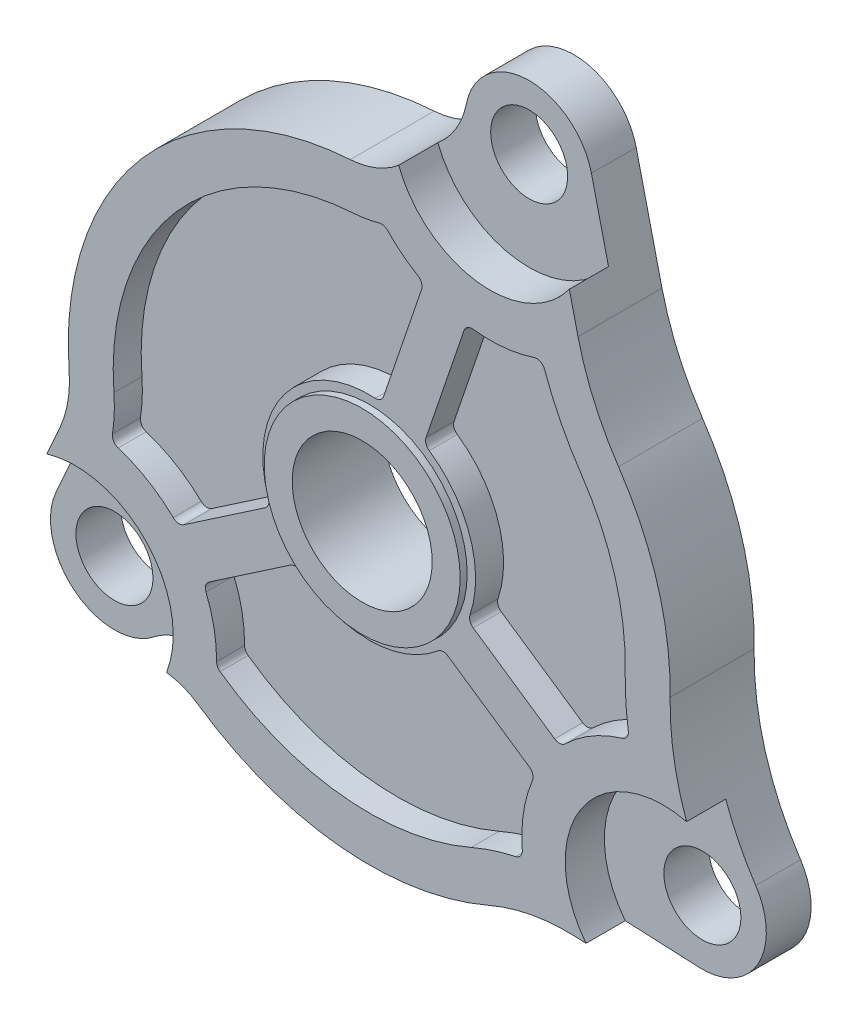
ISO-10303-21;
HEADER;
FILE_DESCRIPTION(('STEP AP214'),'2;1');
FILE_NAME('part.step','',(''),(''),'','','');
FILE_SCHEMA(('AUTOMOTIVE_DESIGN { 1 0 10303 214 1 1 1 1 }'));
ENDSEC;
DATA;
#1=APPLICATION_CONTEXT('core data for automotive mechanical design processes');
#2=APPLICATION_PROTOCOL_DEFINITION('international standard','automotive_design',2000,#1);
#3=PRODUCT_CONTEXT('',#1,'mechanical');
#4=PRODUCT('Part','Part','',(#3));
#5=PRODUCT_RELATED_PRODUCT_CATEGORY('part','',(#4));
#6=PRODUCT_DEFINITION_FORMATION('','',#4);
#7=PRODUCT_DEFINITION_CONTEXT('part definition',#1,'design');
#8=PRODUCT_DEFINITION('design','',#6,#7);
#9=PRODUCT_DEFINITION_SHAPE('','',#8);
#10=(LENGTH_UNIT() NAMED_UNIT(*) SI_UNIT(.MILLI.,.METRE.));
#11=(NAMED_UNIT(*) PLANE_ANGLE_UNIT() SI_UNIT($,.RADIAN.));
#12=(NAMED_UNIT(*) SI_UNIT($,.STERADIAN.) SOLID_ANGLE_UNIT());
#13=UNCERTAINTY_MEASURE_WITH_UNIT(LENGTH_MEASURE(1.E-05),#10,'distance_accuracy_value','');
#14=(GEOMETRIC_REPRESENTATION_CONTEXT(3) GLOBAL_UNCERTAINTY_ASSIGNED_CONTEXT((#13)) GLOBAL_UNIT_ASSIGNED_CONTEXT((#10,
#11,#12)) REPRESENTATION_CONTEXT('',''));
#15=CARTESIAN_POINT('',(0.,0.,0.));
#16=DIRECTION('',(0.,0.,1.));
#17=DIRECTION('',(1.,0.,0.));
#18=AXIS2_PLACEMENT_3D('',#15,#16,#17);
#19=CARTESIAN_POINT('',(-26.67,-18.1463402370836,7.62));
#20=DIRECTION('',(0.,0.,-1.));
#21=DIRECTION('',(-1.,0.,0.));
#22=AXIS2_PLACEMENT_3D('',#19,#20,#21);
#23=CYLINDRICAL_SURFACE('',#22,5.8039);
#24=CARTESIAN_POINT('',(-26.67,-18.1463402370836,4.064));
#25=DIRECTION('',(0.,0.,1.));
#26=DIRECTION('',(1.,0.,0.));
#27=AXIS2_PLACEMENT_3D('',#24,#25,#26);
#28=CIRCLE('',#27,5.8039);
#29=CARTESIAN_POINT('',(-31.9745583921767,-15.7911511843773,4.064));
#30=VERTEX_POINT('',#29);
#31=CARTESIAN_POINT('',(-23.0728419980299,-22.701086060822,4.064));
#32=VERTEX_POINT('',#31);
#33=EDGE_CURVE('E58',#30,#32,#28,.T.);
#34=ORIENTED_EDGE('',*,*,#33,.F.);
#35=DIRECTION('',(0.,0.,-1.));
#36=VECTOR('',#35,1.);
#37=CARTESIAN_POINT('',(-31.9745583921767,-15.7911511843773,7.62));
#38=LINE('',#37,#36);
#39=CARTESIAN_POINT('',(-31.9745583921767,-15.7911511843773,0.));
#40=VERTEX_POINT('',#39);
#41=EDGE_CURVE('E736',#30,#40,#38,.T.);
#42=ORIENTED_EDGE('',*,*,#41,.T.);
#43=CARTESIAN_POINT('',(-26.67,-18.1463402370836,0.));
#44=DIRECTION('',(0.,0.,1.));
#45=DIRECTION('',(1.,0.,0.));
#46=AXIS2_PLACEMENT_3D('',#43,#44,#45);
#47=CIRCLE('',#46,5.8039);
#48=CARTESIAN_POINT('',(-23.0728419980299,-22.701086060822,0.));
#49=VERTEX_POINT('',#48);
#50=EDGE_CURVE('E719',#40,#49,#47,.T.);
#51=ORIENTED_EDGE('',*,*,#50,.T.);
#52=DIRECTION('',(0.,0.,-1.));
#53=VECTOR('',#52,1.);
#54=CARTESIAN_POINT('',(-23.0728419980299,-22.701086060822,7.62));
#55=LINE('',#54,#53);
#56=EDGE_CURVE('E734',#32,#49,#55,.T.);
#57=ORIENTED_EDGE('',*,*,#56,.F.);
#58=EDGE_LOOP('',(#34,#42,#51,#57));
#59=FACE_BOUND('',#58,.T.);
#60=ADVANCED_FACE('F42',(#59),#23,.T.);
#61=CARTESIAN_POINT('',(-26.67,-18.1463402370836,7.62));
#62=DIRECTION('',(0.,0.,-1.));
#63=DIRECTION('',(-1.,0.,0.));
#64=AXIS2_PLACEMENT_3D('',#61,#62,#63);
#65=CYLINDRICAL_SURFACE('',#64,3.4925);
#66=CARTESIAN_POINT('',(-26.67,-18.1463402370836,0.));
#67=DIRECTION('',(0.,0.,1.));
#68=DIRECTION('',(1.,0.,0.));
#69=AXIS2_PLACEMENT_3D('',#66,#67,#68);
#70=CIRCLE('',#69,3.4925);
#71=CARTESIAN_POINT('',(-30.1625,-18.1463402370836,0.));
#72=VERTEX_POINT('',#71);
#73=EDGE_CURVE('E1005',#72,#72,#70,.T.);
#74=CARTESIAN_POINT('',(-26.67,-18.1463402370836,4.064));
#75=DIRECTION('',(0.,0.,1.));
#76=DIRECTION('',(1.,0.,0.));
#77=AXIS2_PLACEMENT_3D('',#74,#75,#76);
#78=CIRCLE('',#77,3.4925);
#79=CARTESIAN_POINT('',(-30.1625,-18.1463402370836,4.064));
#80=VERTEX_POINT('',#79);
#81=EDGE_CURVE('E452',#80,#80,#78,.T.);
#82=CARTESIAN_POINT('',(-30.1625,-18.1463402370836,0.));
#83=CARTESIAN_POINT('',(-30.1625,-18.1463402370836,0.0423333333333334));
#84=CARTESIAN_POINT('',(-30.1625,-18.1463402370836,0.0846666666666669));
#85=CARTESIAN_POINT('',(-30.1625,-18.1463402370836,0.169333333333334));
#86=CARTESIAN_POINT('',(-30.1625,-18.1463402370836,0.211666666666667));
#87=CARTESIAN_POINT('',(-30.1625,-18.1463402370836,0.296333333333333));
#88=CARTESIAN_POINT('',(-30.1625,-18.1463402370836,0.338666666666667));
#89=CARTESIAN_POINT('',(-30.1625,-18.1463402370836,0.423333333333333));
#90=CARTESIAN_POINT('',(-30.1625,-18.1463402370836,0.465666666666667));
#91=CARTESIAN_POINT('',(-30.1625,-18.1463402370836,0.550333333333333));
#92=CARTESIAN_POINT('',(-30.1625,-18.1463402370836,0.592666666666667));
#93=CARTESIAN_POINT('',(-30.1625,-18.1463402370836,0.677333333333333));
#94=CARTESIAN_POINT('',(-30.1625,-18.1463402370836,0.719666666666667));
#95=CARTESIAN_POINT('',(-30.1625,-18.1463402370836,0.804333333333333));
#96=CARTESIAN_POINT('',(-30.1625,-18.1463402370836,0.846666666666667));
#97=CARTESIAN_POINT('',(-30.1625,-18.1463402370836,0.931333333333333));
#98=CARTESIAN_POINT('',(-30.1625,-18.1463402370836,0.973666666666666));
#99=CARTESIAN_POINT('',(-30.1625,-18.1463402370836,1.05833333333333));
#100=CARTESIAN_POINT('',(-30.1625,-18.1463402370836,1.10066666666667));
#101=CARTESIAN_POINT('',(-30.1625,-18.1463402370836,1.18533333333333));
#102=CARTESIAN_POINT('',(-30.1625,-18.1463402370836,1.22766666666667));
#103=CARTESIAN_POINT('',(-30.1625,-18.1463402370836,1.31233333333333));
#104=CARTESIAN_POINT('',(-30.1625,-18.1463402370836,1.35466666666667));
#105=CARTESIAN_POINT('',(-30.1625,-18.1463402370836,1.43933333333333));
#106=CARTESIAN_POINT('',(-30.1625,-18.1463402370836,1.48166666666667));
#107=CARTESIAN_POINT('',(-30.1625,-18.1463402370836,1.56633333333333));
#108=CARTESIAN_POINT('',(-30.1625,-18.1463402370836,1.60866666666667));
#109=CARTESIAN_POINT('',(-30.1625,-18.1463402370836,1.69333333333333));
#110=CARTESIAN_POINT('',(-30.1625,-18.1463402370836,1.73566666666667));
#111=CARTESIAN_POINT('',(-30.1625,-18.1463402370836,1.82033333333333));
#112=CARTESIAN_POINT('',(-30.1625,-18.1463402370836,1.86266666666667));
#113=CARTESIAN_POINT('',(-30.1625,-18.1463402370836,1.94733333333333));
#114=CARTESIAN_POINT('',(-30.1625,-18.1463402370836,1.98966666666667));
#115=CARTESIAN_POINT('',(-30.1625,-18.1463402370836,2.07433333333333));
#116=CARTESIAN_POINT('',(-30.1625,-18.1463402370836,2.11666666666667));
#117=CARTESIAN_POINT('',(-30.1625,-18.1463402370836,2.20133333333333));
#118=CARTESIAN_POINT('',(-30.1625,-18.1463402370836,2.24366666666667));
#119=CARTESIAN_POINT('',(-30.1625,-18.1463402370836,2.32833333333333));
#120=CARTESIAN_POINT('',(-30.1625,-18.1463402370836,2.37066666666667));
#121=CARTESIAN_POINT('',(-30.1625,-18.1463402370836,2.45533333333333));
#122=CARTESIAN_POINT('',(-30.1625,-18.1463402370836,2.49766666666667));
#123=CARTESIAN_POINT('',(-30.1625,-18.1463402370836,2.58233333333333));
#124=CARTESIAN_POINT('',(-30.1625,-18.1463402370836,2.62466666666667));
#125=CARTESIAN_POINT('',(-30.1625,-18.1463402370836,2.70933333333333));
#126=CARTESIAN_POINT('',(-30.1625,-18.1463402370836,2.75166666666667));
#127=CARTESIAN_POINT('',(-30.1625,-18.1463402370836,2.83633333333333));
#128=CARTESIAN_POINT('',(-30.1625,-18.1463402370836,2.87866666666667));
#129=CARTESIAN_POINT('',(-30.1625,-18.1463402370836,2.96333333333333));
#130=CARTESIAN_POINT('',(-30.1625,-18.1463402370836,3.00566666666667));
#131=CARTESIAN_POINT('',(-30.1625,-18.1463402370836,3.09033333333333));
#132=CARTESIAN_POINT('',(-30.1625,-18.1463402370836,3.13266666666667));
#133=CARTESIAN_POINT('',(-30.1625,-18.1463402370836,3.21733333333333));
#134=CARTESIAN_POINT('',(-30.1625,-18.1463402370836,3.25966666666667));
#135=CARTESIAN_POINT('',(-30.1625,-18.1463402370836,3.34433333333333));
#136=CARTESIAN_POINT('',(-30.1625,-18.1463402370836,3.38666666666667));
#137=CARTESIAN_POINT('',(-30.1625,-18.1463402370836,3.47133333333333));
#138=CARTESIAN_POINT('',(-30.1625,-18.1463402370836,3.51366666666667));
#139=CARTESIAN_POINT('',(-30.1625,-18.1463402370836,3.59833333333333));
#140=CARTESIAN_POINT('',(-30.1625,-18.1463402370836,3.64066666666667));
#141=CARTESIAN_POINT('',(-30.1625,-18.1463402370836,3.72533333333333));
#142=CARTESIAN_POINT('',(-30.1625,-18.1463402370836,3.76766666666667));
#143=CARTESIAN_POINT('',(-30.1625,-18.1463402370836,3.85233333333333));
#144=CARTESIAN_POINT('',(-30.1625,-18.1463402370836,3.89466666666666));
#145=CARTESIAN_POINT('',(-30.1625,-18.1463402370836,3.97933333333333));
#146=CARTESIAN_POINT('',(-30.1625,-18.1463402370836,4.02166666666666));
#147=CARTESIAN_POINT('',(-30.1625,-18.1463402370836,4.064));
#148=B_SPLINE_CURVE_WITH_KNOTS('',3,(#82,#83,#84,#85,#86,#87,#88,#89,#90,#91,#92,#93,#94,#95,
#96,#97,#98,#99,#100,#101,#102,#103,#104,#105,#106,#107,#108,#109,#110,#111,#112,#113,#114,#115,
#116,#117,#118,#119,#120,#121,#122,#123,#124,#125,#126,#127,#128,#129,#130,#131,#132,#133,#134,
#135,#136,#137,#138,#139,#140,#141,#142,#143,#144,#145,#146,#147),.UNSPECIFIED.,.F.,.F.,(4,2,2,
2,2,2,2,2,2,2,2,2,2,2,2,2,2,2,2,2,2,2,2,2,2,2,2,2,2,2,2,2,4),(0.,0.127,0.254,0.381,0.508,0.635,
0.762,0.889,1.016,1.143,1.27,1.397,1.524,1.651,1.778,1.905,2.032,2.159,2.286,2.413,2.54,2.667,
2.794,2.921,3.048,3.175,3.302,3.429,3.556,3.683,3.81,3.937,4.064),.UNSPECIFIED.);
#149=EDGE_CURVE('BSEAM896',#72,#80,#148,.T.);
#150=ORIENTED_EDGE('',*,*,#73,.F.);
#151=ORIENTED_EDGE('',*,*,#81,.T.);
#152=ORIENTED_EDGE('',*,*,#149,.T.);
#153=ORIENTED_EDGE('',*,*,#149,.F.);
#154=EDGE_LOOP('',(#150,#152,#151,#153));
#155=FACE_BOUND('',#154,.T.);
#156=ADVANCED_FACE('F896',(#155),#65,.F.);
#157=CARTESIAN_POINT('',(26.67,-18.1463402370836,7.62));
#158=DIRECTION('',(0.,0.,-1.));
#159=DIRECTION('',(-1.,0.,0.));
#160=AXIS2_PLACEMENT_3D('',#157,#158,#159);
#161=CYLINDRICAL_SURFACE('',#160,5.8039);
#162=CARTESIAN_POINT('',(26.67,-18.1463402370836,4.064));
#163=DIRECTION('',(0.,0.,1.));
#164=DIRECTION('',(1.,0.,0.));
#165=AXIS2_PLACEMENT_3D('',#162,#163,#164);
#166=CIRCLE('',#165,5.8039);
#167=CARTESIAN_POINT('',(26.4008012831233,-23.943993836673,4.064));
#168=VERTEX_POINT('',#167);
#169=CARTESIAN_POINT('',(31.5109520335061,-14.9447096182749,4.064));
#170=VERTEX_POINT('',#169);
#171=EDGE_CURVE('E66',#168,#170,#166,.T.);
#172=ORIENTED_EDGE('',*,*,#171,.F.);
#173=DIRECTION('',(0.,0.,-1.));
#174=VECTOR('',#173,1.);
#175=CARTESIAN_POINT('',(26.4008012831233,-23.943993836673,7.62));
#176=LINE('',#175,#174);
#177=CARTESIAN_POINT('',(26.4008012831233,-23.943993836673,0.));
#178=VERTEX_POINT('',#177);
#179=EDGE_CURVE('E984',#168,#178,#176,.T.);
#180=ORIENTED_EDGE('',*,*,#179,.T.);
#181=CARTESIAN_POINT('',(26.67,-18.1463402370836,0.));
#182=DIRECTION('',(0.,0.,1.));
#183=DIRECTION('',(1.,0.,0.));
#184=AXIS2_PLACEMENT_3D('',#181,#182,#183);
#185=CIRCLE('',#184,5.8039);
#186=CARTESIAN_POINT('',(31.5109520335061,-14.9447096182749,0.));
#187=VERTEX_POINT('',#186);
#188=EDGE_CURVE('E798',#178,#187,#185,.T.);
#189=ORIENTED_EDGE('',*,*,#188,.T.);
#190=DIRECTION('',(0.,0.,-1.));
#191=VECTOR('',#190,1.);
#192=CARTESIAN_POINT('',(31.5109520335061,-14.9447096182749,7.62));
#193=LINE('',#192,#191);
#194=EDGE_CURVE('E985',#170,#187,#193,.T.);
#195=ORIENTED_EDGE('',*,*,#194,.F.);
#196=EDGE_LOOP('',(#172,#180,#189,#195));
#197=FACE_BOUND('',#196,.T.);
#198=ADVANCED_FACE('F901',(#197),#161,.T.);
#199=CARTESIAN_POINT('',(26.67,-18.1463402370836,7.62));
#200=DIRECTION('',(0.,0.,-1.));
#201=DIRECTION('',(-1.,0.,0.));
#202=AXIS2_PLACEMENT_3D('',#199,#200,#201);
#203=CYLINDRICAL_SURFACE('',#202,3.4925);
#204=CARTESIAN_POINT('',(26.67,-18.1463402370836,0.));
#205=DIRECTION('',(0.,0.,1.));
#206=DIRECTION('',(1.,0.,0.));
#207=AXIS2_PLACEMENT_3D('',#204,#205,#206);
#208=CIRCLE('',#207,3.4925);
#209=CARTESIAN_POINT('',(23.1775,-18.1463402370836,0.));
#210=VERTEX_POINT('',#209);
#211=EDGE_CURVE('E1009',#210,#210,#208,.T.);
#212=CARTESIAN_POINT('',(26.67,-18.1463402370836,4.064));
#213=DIRECTION('',(0.,0.,1.));
#214=DIRECTION('',(1.,0.,0.));
#215=AXIS2_PLACEMENT_3D('',#212,#213,#214);
#216=CIRCLE('',#215,3.4925);
#217=CARTESIAN_POINT('',(23.1775,-18.1463402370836,4.064));
#218=VERTEX_POINT('',#217);
#219=EDGE_CURVE('E977',#218,#218,#216,.T.);
#220=CARTESIAN_POINT('',(23.1775,-18.1463402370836,0.));
#221=CARTESIAN_POINT('',(23.1775,-18.1463402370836,0.0423333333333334));
#222=CARTESIAN_POINT('',(23.1775,-18.1463402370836,0.0846666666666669));
#223=CARTESIAN_POINT('',(23.1775,-18.1463402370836,0.169333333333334));
#224=CARTESIAN_POINT('',(23.1775,-18.1463402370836,0.211666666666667));
#225=CARTESIAN_POINT('',(23.1775,-18.1463402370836,0.296333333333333));
#226=CARTESIAN_POINT('',(23.1775,-18.1463402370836,0.338666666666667));
#227=CARTESIAN_POINT('',(23.1775,-18.1463402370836,0.423333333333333));
#228=CARTESIAN_POINT('',(23.1775,-18.1463402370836,0.465666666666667));
#229=CARTESIAN_POINT('',(23.1775,-18.1463402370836,0.550333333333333));
#230=CARTESIAN_POINT('',(23.1775,-18.1463402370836,0.592666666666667));
#231=CARTESIAN_POINT('',(23.1775,-18.1463402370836,0.677333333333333));
#232=CARTESIAN_POINT('',(23.1775,-18.1463402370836,0.719666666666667));
#233=CARTESIAN_POINT('',(23.1775,-18.1463402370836,0.804333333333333));
#234=CARTESIAN_POINT('',(23.1775,-18.1463402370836,0.846666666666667));
#235=CARTESIAN_POINT('',(23.1775,-18.1463402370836,0.931333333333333));
#236=CARTESIAN_POINT('',(23.1775,-18.1463402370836,0.973666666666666));
#237=CARTESIAN_POINT('',(23.1775,-18.1463402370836,1.05833333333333));
#238=CARTESIAN_POINT('',(23.1775,-18.1463402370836,1.10066666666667));
#239=CARTESIAN_POINT('',(23.1775,-18.1463402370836,1.18533333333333));
#240=CARTESIAN_POINT('',(23.1775,-18.1463402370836,1.22766666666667));
#241=CARTESIAN_POINT('',(23.1775,-18.1463402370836,1.31233333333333));
#242=CARTESIAN_POINT('',(23.1775,-18.1463402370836,1.35466666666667));
#243=CARTESIAN_POINT('',(23.1775,-18.1463402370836,1.43933333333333));
#244=CARTESIAN_POINT('',(23.1775,-18.1463402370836,1.48166666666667));
#245=CARTESIAN_POINT('',(23.1775,-18.1463402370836,1.56633333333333));
#246=CARTESIAN_POINT('',(23.1775,-18.1463402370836,1.60866666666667));
#247=CARTESIAN_POINT('',(23.1775,-18.1463402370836,1.69333333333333));
#248=CARTESIAN_POINT('',(23.1775,-18.1463402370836,1.73566666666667));
#249=CARTESIAN_POINT('',(23.1775,-18.1463402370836,1.82033333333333));
#250=CARTESIAN_POINT('',(23.1775,-18.1463402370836,1.86266666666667));
#251=CARTESIAN_POINT('',(23.1775,-18.1463402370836,1.94733333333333));
#252=CARTESIAN_POINT('',(23.1775,-18.1463402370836,1.98966666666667));
#253=CARTESIAN_POINT('',(23.1775,-18.1463402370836,2.07433333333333));
#254=CARTESIAN_POINT('',(23.1775,-18.1463402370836,2.11666666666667));
#255=CARTESIAN_POINT('',(23.1775,-18.1463402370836,2.20133333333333));
#256=CARTESIAN_POINT('',(23.1775,-18.1463402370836,2.24366666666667));
#257=CARTESIAN_POINT('',(23.1775,-18.1463402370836,2.32833333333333));
#258=CARTESIAN_POINT('',(23.1775,-18.1463402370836,2.37066666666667));
#259=CARTESIAN_POINT('',(23.1775,-18.1463402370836,2.45533333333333));
#260=CARTESIAN_POINT('',(23.1775,-18.1463402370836,2.49766666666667));
#261=CARTESIAN_POINT('',(23.1775,-18.1463402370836,2.58233333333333));
#262=CARTESIAN_POINT('',(23.1775,-18.1463402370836,2.62466666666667));
#263=CARTESIAN_POINT('',(23.1775,-18.1463402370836,2.70933333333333));
#264=CARTESIAN_POINT('',(23.1775,-18.1463402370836,2.75166666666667));
#265=CARTESIAN_POINT('',(23.1775,-18.1463402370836,2.83633333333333));
#266=CARTESIAN_POINT('',(23.1775,-18.1463402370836,2.87866666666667));
#267=CARTESIAN_POINT('',(23.1775,-18.1463402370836,2.96333333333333));
#268=CARTESIAN_POINT('',(23.1775,-18.1463402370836,3.00566666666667));
#269=CARTESIAN_POINT('',(23.1775,-18.1463402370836,3.09033333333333));
#270=CARTESIAN_POINT('',(23.1775,-18.1463402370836,3.13266666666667));
#271=CARTESIAN_POINT('',(23.1775,-18.1463402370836,3.21733333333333));
#272=CARTESIAN_POINT('',(23.1775,-18.1463402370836,3.25966666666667));
#273=CARTESIAN_POINT('',(23.1775,-18.1463402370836,3.34433333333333));
#274=CARTESIAN_POINT('',(23.1775,-18.1463402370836,3.38666666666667));
#275=CARTESIAN_POINT('',(23.1775,-18.1463402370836,3.47133333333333));
#276=CARTESIAN_POINT('',(23.1775,-18.1463402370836,3.51366666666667));
#277=CARTESIAN_POINT('',(23.1775,-18.1463402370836,3.59833333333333));
#278=CARTESIAN_POINT('',(23.1775,-18.1463402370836,3.64066666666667));
#279=CARTESIAN_POINT('',(23.1775,-18.1463402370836,3.72533333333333));
#280=CARTESIAN_POINT('',(23.1775,-18.1463402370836,3.76766666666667));
#281=CARTESIAN_POINT('',(23.1775,-18.1463402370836,3.85233333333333));
#282=CARTESIAN_POINT('',(23.1775,-18.1463402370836,3.89466666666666));
#283=CARTESIAN_POINT('',(23.1775,-18.1463402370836,3.97933333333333));
#284=CARTESIAN_POINT('',(23.1775,-18.1463402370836,4.02166666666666));
#285=CARTESIAN_POINT('',(23.1775,-18.1463402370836,4.064));
#286=B_SPLINE_CURVE_WITH_KNOTS('',3,(#220,#221,#222,#223,#224,#225,#226,#227,#228,#229,#230,
#231,#232,#233,#234,#235,#236,#237,#238,#239,#240,#241,#242,#243,#244,#245,#246,#247,#248,#249,
#250,#251,#252,#253,#254,#255,#256,#257,#258,#259,#260,#261,#262,#263,#264,#265,#266,#267,#268,
#269,#270,#271,#272,#273,#274,#275,#276,#277,#278,#279,#280,#281,#282,#283,#284,#285),
.UNSPECIFIED.,.F.,.F.,(4,2,2,2,2,2,2,2,2,2,2,2,2,2,2,2,2,2,2,2,2,2,2,2,2,2,2,2,2,2,2,2,4),(0.,
0.127,0.254,0.381,0.508,0.635,0.762,0.889,1.016,1.143,1.27,1.397,1.524,1.651,1.778,1.905,2.032,
2.159,2.286,2.413,2.54,2.667,2.794,2.921,3.048,3.175,3.302,3.429,3.556,3.683,3.81,3.937,4.064),.UNSPECIFIED.);
#287=EDGE_CURVE('BSEAM922',#210,#218,#286,.T.);
#288=ORIENTED_EDGE('',*,*,#211,.F.);
#289=ORIENTED_EDGE('',*,*,#219,.T.);
#290=ORIENTED_EDGE('',*,*,#287,.T.);
#291=ORIENTED_EDGE('',*,*,#287,.F.);
#292=EDGE_LOOP('',(#288,#290,#289,#291));
#293=FACE_BOUND('',#292,.T.);
#294=ADVANCED_FACE('F922',(#293),#203,.F.);
#295=CARTESIAN_POINT('',(10.9562814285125,32.2243571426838,7.62));
#296=DIRECTION('',(0.,0.,-1.));
#297=DIRECTION('',(-1.,0.,0.));
#298=AXIS2_PLACEMENT_3D('',#295,#296,#297);
#299=CYLINDRICAL_SURFACE('',#298,5.8039);
#300=CARTESIAN_POINT('',(10.9562814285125,32.2243571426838,4.064));
#301=DIRECTION('',(0.,0.,1.));
#302=DIRECTION('',(1.,0.,0.));
#303=AXIS2_PLACEMENT_3D('',#300,#301,#302);
#304=CIRCLE('',#303,5.8039);
#305=CARTESIAN_POINT('',(16.6042561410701,33.5606343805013,4.064));
#306=VERTEX_POINT('',#305);
#307=CARTESIAN_POINT('',(5.26493172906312,33.361807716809,4.064));
#308=VERTEX_POINT('',#307);
#309=EDGE_CURVE('E822',#306,#308,#304,.T.);
#310=ORIENTED_EDGE('',*,*,#309,.F.);
#311=DIRECTION('',(0.,0.,-1.));
#312=VECTOR('',#311,1.);
#313=CARTESIAN_POINT('',(16.6042561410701,33.5606343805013,7.62));
#314=LINE('',#313,#312);
#315=CARTESIAN_POINT('',(16.6042561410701,33.5606343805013,0.));
#316=VERTEX_POINT('',#315);
#317=EDGE_CURVE('E777',#306,#316,#314,.T.);
#318=ORIENTED_EDGE('',*,*,#317,.T.);
#319=CARTESIAN_POINT('',(10.9562814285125,32.2243571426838,0.));
#320=DIRECTION('',(0.,0.,1.));
#321=DIRECTION('',(1.,0.,0.));
#322=AXIS2_PLACEMENT_3D('',#319,#320,#321);
#323=CIRCLE('',#322,5.8039);
#324=CARTESIAN_POINT('',(5.26493172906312,33.361807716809,0.));
#325=VERTEX_POINT('',#324);
#326=EDGE_CURVE('E759',#316,#325,#323,.T.);
#327=ORIENTED_EDGE('',*,*,#326,.T.);
#328=DIRECTION('',(0.,0.,-1.));
#329=VECTOR('',#328,1.);
#330=CARTESIAN_POINT('',(5.26493172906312,33.361807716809,7.62));
#331=LINE('',#330,#329);
#332=EDGE_CURVE('E775',#308,#325,#331,.T.);
#333=ORIENTED_EDGE('',*,*,#332,.F.);
#334=EDGE_LOOP('',(#310,#318,#327,#333));
#335=FACE_BOUND('',#334,.T.);
#336=ADVANCED_FACE('F918',(#335),#299,.T.);
#337=CARTESIAN_POINT('',(-2.20729982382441,34.8551782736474,7.62));
#338=DIRECTION('',(0.,0.,-1.));
#339=DIRECTION('',(-1.,0.,0.));
#340=AXIS2_PLACEMENT_3D('',#337,#338,#339);
#341=CYLINDRICAL_SURFACE('',#340,7.62);
#342=DIRECTION('',(0.,0.,1.));
#343=VECTOR('',#342,1.);
#344=CARTESIAN_POINT('',(2.67105303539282,29.0014562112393,4.064));
#345=LINE('',#344,#343);
#346=CARTESIAN_POINT('',(2.67105303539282,29.0014562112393,4.064));
#347=VERTEX_POINT('',#346);
#348=CARTESIAN_POINT('',(2.67105303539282,29.0014562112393,7.62));
#349=VERTEX_POINT('',#348);
#350=EDGE_CURVE('E817',#347,#349,#345,.T.);
#351=ORIENTED_EDGE('',*,*,#350,.F.);
#352=CARTESIAN_POINT('',(-2.20729982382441,34.8551782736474,4.064));
#353=DIRECTION('',(0.,0.,1.));
#354=DIRECTION('',(1.,0.,0.));
#355=AXIS2_PLACEMENT_3D('',#352,#353,#354);
#356=CIRCLE('',#355,7.62);
#357=EDGE_CURVE('E820',#308,#347,#356,.F.);
#358=ORIENTED_EDGE('',*,*,#357,.F.);
#359=ORIENTED_EDGE('',*,*,#332,.T.);
#360=CARTESIAN_POINT('',(-2.20729982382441,34.8551782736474,0.));
#361=DIRECTION('',(0.,0.,-1.));
#362=DIRECTION('',(-1.,0.,0.));
#363=AXIS2_PLACEMENT_3D('',#360,#361,#362);
#364=CIRCLE('',#363,7.62);
#365=CARTESIAN_POINT('',(-1.72570713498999,27.2504121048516,0.));
#366=VERTEX_POINT('',#365);
#367=EDGE_CURVE('E766',#325,#366,#364,.T.);
#368=ORIENTED_EDGE('',*,*,#367,.T.);
#369=DIRECTION('',(0.,0.,-1.));
#370=VECTOR('',#369,1.);
#371=CARTESIAN_POINT('',(-1.72570713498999,27.2504121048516,7.62));
#372=LINE('',#371,#370);
#373=CARTESIAN_POINT('',(-1.72570713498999,27.2504121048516,7.62));
#374=VERTEX_POINT('',#373);
#375=EDGE_CURVE('E746',#374,#366,#372,.T.);
#376=ORIENTED_EDGE('',*,*,#375,.F.);
#377=CARTESIAN_POINT('',(-2.20729982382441,34.8551782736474,7.62));
#378=DIRECTION('',(0.,0.,-1.));
#379=DIRECTION('',(-1.,0.,0.));
#380=AXIS2_PLACEMENT_3D('',#377,#378,#379);
#381=CIRCLE('',#380,7.62);
#382=EDGE_CURVE('E848',#349,#374,#381,.T.);
#383=ORIENTED_EDGE('',*,*,#382,.F.);
#384=EDGE_LOOP('',(#351,#358,#359,#368,#376,#383));
#385=FACE_BOUND('',#384,.T.);
#386=ADVANCED_FACE('F914',(#385),#341,.F.);
#387=CARTESIAN_POINT('',(10.9562814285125,32.2243571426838,7.62));
#388=DIRECTION('',(0.,0.,-1.));
#389=DIRECTION('',(-1.,0.,0.));
#390=AXIS2_PLACEMENT_3D('',#387,#388,#389);
#391=CYLINDRICAL_SURFACE('',#390,3.4925);
#392=CARTESIAN_POINT('',(10.9562814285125,32.2243571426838,0.));
#393=DIRECTION('',(0.,0.,1.));
#394=DIRECTION('',(1.,0.,0.));
#395=AXIS2_PLACEMENT_3D('',#392,#393,#394);
#396=CIRCLE('',#395,3.4925);
#397=CARTESIAN_POINT('',(7.46378142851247,32.2243571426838,0.));
#398=VERTEX_POINT('',#397);
#399=EDGE_CURVE('E963',#398,#398,#396,.T.);
#400=CARTESIAN_POINT('',(10.9562814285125,32.2243571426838,4.064));
#401=DIRECTION('',(0.,0.,1.));
#402=DIRECTION('',(1.,0.,0.));
#403=AXIS2_PLACEMENT_3D('',#400,#401,#402);
#404=CIRCLE('',#403,3.4925);
#405=CARTESIAN_POINT('',(7.46378142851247,32.2243571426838,4.064));
#406=VERTEX_POINT('',#405);
#407=EDGE_CURVE('E816',#406,#406,#404,.T.);
#408=CARTESIAN_POINT('',(7.46378142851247,32.2243571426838,0.));
#409=CARTESIAN_POINT('',(7.46378142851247,32.2243571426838,0.0423333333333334));
#410=CARTESIAN_POINT('',(7.46378142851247,32.2243571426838,0.0846666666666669));
#411=CARTESIAN_POINT('',(7.46378142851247,32.2243571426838,0.169333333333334));
#412=CARTESIAN_POINT('',(7.46378142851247,32.2243571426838,0.211666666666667));
#413=CARTESIAN_POINT('',(7.46378142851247,32.2243571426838,0.296333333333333));
#414=CARTESIAN_POINT('',(7.46378142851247,32.2243571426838,0.338666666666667));
#415=CARTESIAN_POINT('',(7.46378142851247,32.2243571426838,0.423333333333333));
#416=CARTESIAN_POINT('',(7.46378142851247,32.2243571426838,0.465666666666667));
#417=CARTESIAN_POINT('',(7.46378142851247,32.2243571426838,0.550333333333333));
#418=CARTESIAN_POINT('',(7.46378142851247,32.2243571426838,0.592666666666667));
#419=CARTESIAN_POINT('',(7.46378142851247,32.2243571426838,0.677333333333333));
#420=CARTESIAN_POINT('',(7.46378142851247,32.2243571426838,0.719666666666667));
#421=CARTESIAN_POINT('',(7.46378142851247,32.2243571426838,0.804333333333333));
#422=CARTESIAN_POINT('',(7.46378142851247,32.2243571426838,0.846666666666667));
#423=CARTESIAN_POINT('',(7.46378142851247,32.2243571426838,0.931333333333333));
#424=CARTESIAN_POINT('',(7.46378142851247,32.2243571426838,0.973666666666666));
#425=CARTESIAN_POINT('',(7.46378142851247,32.2243571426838,1.05833333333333));
#426=CARTESIAN_POINT('',(7.46378142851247,32.2243571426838,1.10066666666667));
#427=CARTESIAN_POINT('',(7.46378142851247,32.2243571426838,1.18533333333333));
#428=CARTESIAN_POINT('',(7.46378142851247,32.2243571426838,1.22766666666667));
#429=CARTESIAN_POINT('',(7.46378142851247,32.2243571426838,1.31233333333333));
#430=CARTESIAN_POINT('',(7.46378142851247,32.2243571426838,1.35466666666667));
#431=CARTESIAN_POINT('',(7.46378142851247,32.2243571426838,1.43933333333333));
#432=CARTESIAN_POINT('',(7.46378142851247,32.2243571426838,1.48166666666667));
#433=CARTESIAN_POINT('',(7.46378142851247,32.2243571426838,1.56633333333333));
#434=CARTESIAN_POINT('',(7.46378142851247,32.2243571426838,1.60866666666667));
#435=CARTESIAN_POINT('',(7.46378142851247,32.2243571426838,1.69333333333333));
#436=CARTESIAN_POINT('',(7.46378142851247,32.2243571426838,1.73566666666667));
#437=CARTESIAN_POINT('',(7.46378142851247,32.2243571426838,1.82033333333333));
#438=CARTESIAN_POINT('',(7.46378142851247,32.2243571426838,1.86266666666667));
#439=CARTESIAN_POINT('',(7.46378142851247,32.2243571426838,1.94733333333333));
#440=CARTESIAN_POINT('',(7.46378142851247,32.2243571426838,1.98966666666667));
#441=CARTESIAN_POINT('',(7.46378142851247,32.2243571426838,2.07433333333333));
#442=CARTESIAN_POINT('',(7.46378142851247,32.2243571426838,2.11666666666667));
#443=CARTESIAN_POINT('',(7.46378142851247,32.2243571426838,2.20133333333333));
#444=CARTESIAN_POINT('',(7.46378142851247,32.2243571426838,2.24366666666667));
#445=CARTESIAN_POINT('',(7.46378142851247,32.2243571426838,2.32833333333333));
#446=CARTESIAN_POINT('',(7.46378142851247,32.2243571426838,2.37066666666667));
#447=CARTESIAN_POINT('',(7.46378142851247,32.2243571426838,2.45533333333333));
#448=CARTESIAN_POINT('',(7.46378142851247,32.2243571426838,2.49766666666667));
#449=CARTESIAN_POINT('',(7.46378142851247,32.2243571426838,2.58233333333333));
#450=CARTESIAN_POINT('',(7.46378142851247,32.2243571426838,2.62466666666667));
#451=CARTESIAN_POINT('',(7.46378142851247,32.2243571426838,2.70933333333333));
#452=CARTESIAN_POINT('',(7.46378142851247,32.2243571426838,2.75166666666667));
#453=CARTESIAN_POINT('',(7.46378142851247,32.2243571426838,2.83633333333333));
#454=CARTESIAN_POINT('',(7.46378142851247,32.2243571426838,2.87866666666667));
#455=CARTESIAN_POINT('',(7.46378142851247,32.2243571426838,2.96333333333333));
#456=CARTESIAN_POINT('',(7.46378142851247,32.2243571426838,3.00566666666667));
#457=CARTESIAN_POINT('',(7.46378142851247,32.2243571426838,3.09033333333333));
#458=CARTESIAN_POINT('',(7.46378142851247,32.2243571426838,3.13266666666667));
#459=CARTESIAN_POINT('',(7.46378142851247,32.2243571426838,3.21733333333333));
#460=CARTESIAN_POINT('',(7.46378142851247,32.2243571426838,3.25966666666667));
#461=CARTESIAN_POINT('',(7.46378142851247,32.2243571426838,3.34433333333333));
#462=CARTESIAN_POINT('',(7.46378142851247,32.2243571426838,3.38666666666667));
#463=CARTESIAN_POINT('',(7.46378142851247,32.2243571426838,3.47133333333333));
#464=CARTESIAN_POINT('',(7.46378142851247,32.2243571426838,3.51366666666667));
#465=CARTESIAN_POINT('',(7.46378142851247,32.2243571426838,3.59833333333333));
#466=CARTESIAN_POINT('',(7.46378142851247,32.2243571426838,3.64066666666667));
#467=CARTESIAN_POINT('',(7.46378142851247,32.2243571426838,3.72533333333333));
#468=CARTESIAN_POINT('',(7.46378142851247,32.2243571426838,3.76766666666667));
#469=CARTESIAN_POINT('',(7.46378142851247,32.2243571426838,3.85233333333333));
#470=CARTESIAN_POINT('',(7.46378142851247,32.2243571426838,3.89466666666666));
#471=CARTESIAN_POINT('',(7.46378142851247,32.2243571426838,3.97933333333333));
#472=CARTESIAN_POINT('',(7.46378142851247,32.2243571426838,4.02166666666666));
#473=CARTESIAN_POINT('',(7.46378142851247,32.2243571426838,4.064));
#474=B_SPLINE_CURVE_WITH_KNOTS('',3,(#408,#409,#410,#411,#412,#413,#414,#415,#416,#417,#418,
#419,#420,#421,#422,#423,#424,#425,#426,#427,#428,#429,#430,#431,#432,#433,#434,#435,#436,#437,
#438,#439,#440,#441,#442,#443,#444,#445,#446,#447,#448,#449,#450,#451,#452,#453,#454,#455,#456,
#457,#458,#459,#460,#461,#462,#463,#464,#465,#466,#467,#468,#469,#470,#471,#472,#473),
.UNSPECIFIED.,.F.,.F.,(4,2,2,2,2,2,2,2,2,2,2,2,2,2,2,2,2,2,2,2,2,2,2,2,2,2,2,2,2,2,2,2,4),(0.,
0.127,0.254,0.381,0.508,0.635,0.762,0.889,1.016,1.143,1.27,1.397,1.524,1.651,1.778,1.905,2.032,
2.159,2.286,2.413,2.54,2.667,2.794,2.921,3.048,3.175,3.302,3.429,3.556,3.683,3.81,3.937,4.064),.UNSPECIFIED.);
#475=EDGE_CURVE('BSEAM917',#398,#406,#474,.T.);
#476=ORIENTED_EDGE('',*,*,#399,.F.);
#477=ORIENTED_EDGE('',*,*,#407,.T.);
#478=ORIENTED_EDGE('',*,*,#475,.T.);
#479=ORIENTED_EDGE('',*,*,#475,.F.);
#480=EDGE_LOOP('',(#476,#478,#477,#479));
#481=FACE_BOUND('',#480,.T.);
#482=ADVANCED_FACE('F917',(#481),#391,.F.);
#483=CARTESIAN_POINT('',(0.,0.,7.62));
#484=DIRECTION('',(0.,0.,1.));
#485=DIRECTION('',(1.,0.,0.));
#486=AXIS2_PLACEMENT_3D('',#483,#484,#485);
#487=PLANE('',#486);
#488=CARTESIAN_POINT('',(-26.67,-18.1463402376,7.62));
#489=DIRECTION('',(0.,0.,1.));
#490=DIRECTION('',(1.,0.,0.));
#491=AXIS2_PLACEMENT_3D('',#488,#489,#490);
#492=CIRCLE('',#491,8.89);
#493=CARTESIAN_POINT('',(-18.3884559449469,-21.3786966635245,7.62));
#494=VERTEX_POINT('',#493);
#495=CARTESIAN_POINT('',(-29.2419376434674,-9.63650846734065,7.62));
#496=VERTEX_POINT('',#495);
#497=EDGE_CURVE('E431',#494,#496,#492,.T.);
#498=ORIENTED_EDGE('',*,*,#497,.F.);
#499=CARTESIAN_POINT('',(-19.137220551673,-27.6843965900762,7.62));
#500=DIRECTION('',(0.,0.,1.));
#501=DIRECTION('',(1.,0.,0.));
#502=AXIS2_PLACEMENT_3D('',#499,#500,#501);
#503=CIRCLE('',#502,6.35);
#504=CARTESIAN_POINT('',(-15.5264242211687,-22.4609255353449,7.62));
#505=VERTEX_POINT('',#504);
#506=EDGE_CURVE('E459',#505,#494,#503,.T.);
#507=ORIENTED_EDGE('',*,*,#506,.F.);
#508=CARTESIAN_POINT('',(0.,0.,7.62));
#509=DIRECTION('',(0.,0.,1.));
#510=DIRECTION('',(1.,0.,0.));
#511=AXIS2_PLACEMENT_3D('',#508,#509,#510);
#512=CIRCLE('',#511,27.305);
#513=CARTESIAN_POINT('',(10.8798015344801,-25.0438204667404,7.62));
#514=VERTEX_POINT('',#513);
#515=EDGE_CURVE('E657',#505,#514,#512,.T.);
#516=ORIENTED_EDGE('',*,*,#515,.T.);
#517=CARTESIAN_POINT('',(17.964323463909,-41.3514244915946,7.62));
#518=DIRECTION('',(0.,0.,1.));
#519=DIRECTION('',(1.,0.,0.));
#520=AXIS2_PLACEMENT_3D('',#517,#518,#519);
#521=CIRCLE('',#520,17.78);
#522=CARTESIAN_POINT('',(18.7890022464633,-23.5905600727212,7.62));
#523=VERTEX_POINT('',#522);
#524=EDGE_CURVE('E660',#523,#514,#521,.T.);
#525=ORIENTED_EDGE('',*,*,#524,.F.);
#526=DIRECTION('',(0.99892375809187,-0.0463823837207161,0.));
#527=VECTOR('',#526,1.);
#528=CARTESIAN_POINT('',(18.7890022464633,-23.5905600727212,7.62));
#529=LINE('',#528,#527);
#530=CARTESIAN_POINT('',(19.6740419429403,-23.6316543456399,7.62));
#531=VERTEX_POINT('',#530);
#532=EDGE_CURVE('E667',#523,#531,#529,.T.);
#533=ORIENTED_EDGE('',*,*,#532,.T.);
#534=CARTESIAN_POINT('',(26.67,-18.1463402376,7.62));
#535=DIRECTION('',(0.,0.,1.));
#536=DIRECTION('',(1.,0.,0.));
#537=AXIS2_PLACEMENT_3D('',#534,#535,#536);
#538=CIRCLE('',#537,8.89);
#539=CARTESIAN_POINT('',(28.7895875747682,-9.51271709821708,7.62));
#540=VERTEX_POINT('',#539);
#541=EDGE_CURVE('E678',#540,#531,#538,.T.);
#542=ORIENTED_EDGE('',*,*,#541,.F.);
#543=CARTESIAN_POINT('',(52.6967377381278,-0.933197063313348,7.62));
#544=DIRECTION('',(0.,0.,-1.));
#545=DIRECTION('',(-1.,0.,0.));
#546=AXIS2_PLACEMENT_3D('',#543,#544,#545);
#547=CIRCLE('',#546,25.4);
#548=CARTESIAN_POINT('',(27.3007195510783,-0.483463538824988,7.62));
#549=VERTEX_POINT('',#548);
#550=EDGE_CURVE('E671',#540,#549,#547,.T.);
#551=ORIENTED_EDGE('',*,*,#550,.T.);
#552=CARTESIAN_POINT('',(0.,0.,7.62));
#553=DIRECTION('',(0.,0.,1.));
#554=DIRECTION('',(1.,0.,0.));
#555=AXIS2_PLACEMENT_3D('',#552,#553,#554);
#556=CIRCLE('',#555,27.305);
#557=CARTESIAN_POINT('',(22.619598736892,15.2943381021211,7.62));
#558=VERTEX_POINT('',#557);
#559=EDGE_CURVE('E2008',#549,#558,#556,.T.);
#560=ORIENTED_EDGE('',*,*,#559,.T.);
#561=CARTESIAN_POINT('',(43.6610859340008,29.5216293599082,7.62));
#562=DIRECTION('',(0.,0.,-1.));
#563=DIRECTION('',(-1.,0.,0.));
#564=AXIS2_PLACEMENT_3D('',#561,#562,#563);
#565=CIRCLE('',#564,25.4);
#566=CARTESIAN_POINT('',(18.9434723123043,23.6735889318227,7.62));
#567=VERTEX_POINT('',#566);
#568=EDGE_CURVE('E2014',#558,#567,#565,.T.);
#569=ORIENTED_EDGE('',*,*,#568,.T.);
#570=DIRECTION('',(0.230237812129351,-0.973134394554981,0.));
#571=VECTOR('',#570,1.);
#572=CARTESIAN_POINT('',(16.6042561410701,33.5606343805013,7.62));
#573=LINE('',#572,#571);
#574=CARTESIAN_POINT('',(18.1546786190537,27.0075402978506,7.62));
#575=VERTEX_POINT('',#574);
#576=EDGE_CURVE('E850',#575,#567,#573,.T.);
#577=ORIENTED_EDGE('',*,*,#576,.F.);
#578=CARTESIAN_POINT('',(10.9562814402,32.224357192,7.62));
#579=DIRECTION('',(0.,0.,1.));
#580=DIRECTION('',(1.,0.,0.));
#581=AXIS2_PLACEMENT_3D('',#578,#579,#580);
#582=CIRCLE('',#581,8.8900000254);
#583=EDGE_CURVE('E837',#349,#575,#582,.T.);
#584=ORIENTED_EDGE('',*,*,#583,.F.);
#585=ORIENTED_EDGE('',*,*,#382,.T.);
#586=CARTESIAN_POINT('',(0.,0.,7.62));
#587=DIRECTION('',(0.,0.,1.));
#588=DIRECTION('',(1.,0.,0.));
#589=AXIS2_PLACEMENT_3D('',#586,#587,#588);
#590=CIRCLE('',#589,27.305);
#591=CARTESIAN_POINT('',(-27.2246734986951,-2.0928874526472,7.62));
#592=VERTEX_POINT('',#591);
#593=EDGE_CURVE('E463',#374,#592,#590,.T.);
#594=ORIENTED_EDGE('',*,*,#593,.T.);
#595=CARTESIAN_POINT('',(-37.354784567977,-2.87163627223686,7.62));
#596=DIRECTION('',(0.,0.,-1.));
#597=DIRECTION('',(-1.,0.,0.));
#598=AXIS2_PLACEMENT_3D('',#595,#596,#597);
#599=CIRCLE('',#598,10.16);
#600=CARTESIAN_POINT('',(-28.068905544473,-6.99450551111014,7.62));
#601=VERTEX_POINT('',#600);
#602=EDGE_CURVE('E457',#592,#601,#599,.T.);
#603=ORIENTED_EDGE('',*,*,#602,.T.);
#604=DIRECTION('',(-0.405794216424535,-0.913964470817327,0.));
#605=VECTOR('',#604,1.);
#606=CARTESIAN_POINT('',(-28.068905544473,-6.99450551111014,7.62));
#607=LINE('',#606,#605);
#608=EDGE_CURVE('E449',#601,#496,#607,.T.);
#609=ORIENTED_EDGE('',*,*,#608,.T.);
#610=EDGE_LOOP('',(#498,#507,#516,#525,#533,#542,#551,#560,#569,#577,#584,#585,#594,#603,#609));
#611=FACE_BOUND('',#610,.T.);
#612=CARTESIAN_POINT('',(-13.0843284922,-18.2636828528,7.62));
#613=DIRECTION('',(0.,0.,1.));
#614=DIRECTION('',(1.,0.,0.));
#615=AXIS2_PLACEMENT_3D('',#612,#613,#614);
#616=CIRCLE('',#615,0.761999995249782);
#617=CARTESIAN_POINT('',(-13.8463000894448,-18.2571045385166,7.62));
#618=VERTEX_POINT('',#617);
#619=CARTESIAN_POINT('',(-13.5281064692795,-18.8831221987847,7.62));
#620=VERTEX_POINT('',#619);
#621=EDGE_CURVE('E1048',#618,#620,#616,.T.);
#622=ORIENTED_EDGE('',*,*,#621,.F.);
#623=CARTESIAN_POINT('',(-26.67,-18.1463402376,7.62));
#624=DIRECTION('',(0.,0.,1.));
#625=DIRECTION('',(1.,0.,0.));
#626=AXIS2_PLACEMENT_3D('',#623,#624,#625);
#627=CIRCLE('',#626,12.8241782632);
#628=CARTESIAN_POINT('',(-14.8103813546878,-13.266894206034,7.62));
#629=VERTEX_POINT('',#628);
#630=EDGE_CURVE('E634',#618,#629,#627,.T.);
#631=ORIENTED_EDGE('',*,*,#630,.T.);
#632=CARTESIAN_POINT('',(-14.105694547,-12.9769623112,7.62));
#633=DIRECTION('',(0.,0.,1.));
#634=DIRECTION('',(1.,0.,0.));
#635=AXIS2_PLACEMENT_3D('',#632,#633,#634);
#636=CIRCLE('',#635,0.762000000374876);
#637=CARTESIAN_POINT('',(-14.534348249,-12.3469623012,7.62));
#638=VERTEX_POINT('',#637);
#639=EDGE_CURVE('E643',#638,#629,#636,.T.);
#640=ORIENTED_EDGE('',*,*,#639,.F.);
#641=DIRECTION('',(0.826771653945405,0.562537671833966,0.));
#642=VECTOR('',#641,1.);
#643=CARTESIAN_POINT('',(-14.534348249,-12.3469623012,7.62));
#644=LINE('',#643,#642);
#645=CARTESIAN_POINT('',(-7.15125891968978,-7.323488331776,7.62));
#646=VERTEX_POINT('',#645);
#647=EDGE_CURVE('E1091',#638,#646,#644,.T.);
#648=ORIENTED_EDGE('',*,*,#647,.T.);
#649=CARTESIAN_POINT('',(-6.7226051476,-7.953488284,7.62));
#650=DIRECTION('',(0.,0.,1.));
#651=DIRECTION('',(1.,0.,0.));
#652=AXIS2_PLACEMENT_3D('',#649,#650,#651);
#653=CIRCLE('',#652,0.76199999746);
#654=CARTESIAN_POINT('',(-6.23070722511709,-7.37152570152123,7.62));
#655=VERTEX_POINT('',#654);
#656=EDGE_CURVE('E1080',#655,#646,#653,.T.);
#657=ORIENTED_EDGE('',*,*,#656,.F.);
#658=CARTESIAN_POINT('',(0.,0.,7.62));
#659=DIRECTION('',(0.,0.,1.));
#660=DIRECTION('',(1.,0.,0.));
#661=AXIS2_PLACEMENT_3D('',#658,#659,#660);
#662=CIRCLE('',#661,9.65199998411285);
#663=CARTESIAN_POINT('',(6.23070723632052,-7.37152567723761,7.62));
#664=VERTEX_POINT('',#663);
#665=EDGE_CURVE('E1081',#655,#664,#662,.T.);
#666=ORIENTED_EDGE('',*,*,#665,.T.);
#667=CARTESIAN_POINT('',(6.7226051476,-7.953488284,7.62));
#668=DIRECTION('',(0.,0.,1.));
#669=DIRECTION('',(1.,0.,0.));
#670=AXIS2_PLACEMENT_3D('',#667,#668,#669);
#671=CIRCLE('',#670,0.762000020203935);
#672=CARTESIAN_POINT('',(7.151258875,-7.323488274,7.62));
#673=VERTEX_POINT('',#672);
#674=EDGE_CURVE('E1070',#673,#664,#671,.T.);
#675=ORIENTED_EDGE('',*,*,#674,.F.);
#676=DIRECTION('',(0.826771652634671,-0.562537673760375,0.));
#677=VECTOR('',#676,1.);
#678=CARTESIAN_POINT('',(7.151258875,-7.323488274,7.62));
#679=LINE('',#678,#677);
#680=CARTESIAN_POINT('',(14.5343482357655,-12.3469622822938,7.62));
#681=VERTEX_POINT('',#680);
#682=EDGE_CURVE('E1071',#673,#681,#679,.T.);
#683=ORIENTED_EDGE('',*,*,#682,.T.);
#684=CARTESIAN_POINT('',(14.105694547,-12.9769623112,7.62));
#685=DIRECTION('',(0.,0.,1.));
#686=DIRECTION('',(1.,0.,0.));
#687=AXIS2_PLACEMENT_3D('',#684,#685,#686);
#688=CIRCLE('',#687,0.762000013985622);
#689=CARTESIAN_POINT('',(14.8103818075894,-13.2668931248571,7.62));
#690=VERTEX_POINT('',#689);
#691=EDGE_CURVE('E1059',#690,#681,#688,.T.);
#692=ORIENTED_EDGE('',*,*,#691,.F.);
#693=CARTESIAN_POINT('',(26.67,-18.1463402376,7.62));
#694=DIRECTION('',(0.,0.,1.));
#695=DIRECTION('',(1.,0.,0.));
#696=AXIS2_PLACEMENT_3D('',#693,#694,#695);
#697=CIRCLE('',#696,12.8241782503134);
#698=CARTESIAN_POINT('',(13.8886812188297,-19.1939266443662,7.62));
#699=VERTEX_POINT('',#698);
#700=EDGE_CURVE('E1060',#690,#699,#697,.T.);
#701=ORIENTED_EDGE('',*,*,#700,.T.);
#702=CARTESIAN_POINT('',(13.1292278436,-19.256173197,7.62));
#703=DIRECTION('',(0.,0.,1.));
#704=DIRECTION('',(1.,0.,0.));
#705=AXIS2_PLACEMENT_3D('',#702,#703,#704);
#706=CIRCLE('',#705,0.762000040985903);
#707=CARTESIAN_POINT('',(13.2921224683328,-20.0005584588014,7.62));
#708=VERTEX_POINT('',#707);
#709=EDGE_CURVE('E1047',#708,#699,#706,.T.);
#710=ORIENTED_EDGE('',*,*,#709,.F.);
#711=CARTESIAN_POINT('',(17.9643234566,-41.351424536,7.62));
#712=DIRECTION('',(0.,0.,1.));
#713=DIRECTION('',(1.,0.,0.));
#714=AXIS2_PLACEMENT_3D('',#711,#712,#713);
#715=CIRCLE('',#714,21.8560962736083);
#716=CARTESIAN_POINT('',(9.255658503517,-21.3052752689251,7.62));
#717=VERTEX_POINT('',#716);
#718=EDGE_CURVE('E1050',#708,#717,#715,.T.);
#719=ORIENTED_EDGE('',*,*,#718,.T.);
#720=CARTESIAN_POINT('',(0.,0.,7.62));
#721=DIRECTION('',(0.,0.,1.));
#722=DIRECTION('',(1.,0.,0.));
#723=AXIS2_PLACEMENT_3D('',#720,#721,#722);
#724=CIRCLE('',#723,23.2289037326);
#725=EDGE_CURVE('E1044',#620,#717,#724,.T.);
#726=ORIENTED_EDGE('',*,*,#725,.F.);
#727=EDGE_LOOP('',(#622,#631,#640,#648,#657,#666,#675,#683,#692,#701,#710,#719,#726));
#728=FACE_BOUND('',#727,.T.);
#729=CARTESIAN_POINT('',(9.3216160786,18.736877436,7.62));
#730=DIRECTION('',(0.,0.,1.));
#731=DIRECTION('',(1.,0.,0.));
#732=AXIS2_PLACEMENT_3D('',#729,#730,#731);
#733=CIRCLE('',#732,0.761999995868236);
#734=CARTESIAN_POINT('',(9.41329857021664,19.4933418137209,7.62));
#735=VERTEX_POINT('',#734);
#736=CARTESIAN_POINT('',(8.6001752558,18.9821673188,7.62));
#737=VERTEX_POINT('',#736);
#738=EDGE_CURVE('E639',#735,#737,#733,.T.);
#739=ORIENTED_EDGE('',*,*,#738,.F.);
#740=CARTESIAN_POINT('',(10.9562814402,32.224357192,7.62));
#741=DIRECTION('',(0.,0.,1.));
#742=DIRECTION('',(1.,0.,0.));
#743=AXIS2_PLACEMENT_3D('',#740,#741,#742);
#744=CIRCLE('',#743,12.8241782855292);
#745=CARTESIAN_POINT('',(14.9591050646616,20.0408867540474,7.62));
#746=VERTEX_POINT('',#745);
#747=EDGE_CURVE('E505',#735,#746,#744,.T.);
#748=ORIENTED_EDGE('',*,*,#747,.T.);
#749=CARTESIAN_POINT('',(15.1969484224,19.3169568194,7.62));
#750=DIRECTION('',(0.,0.,1.));
#751=DIRECTION('',(1.,0.,0.));
#752=AXIS2_PLACEMENT_3D('',#749,#750,#751);
#753=CIRCLE('',#752,0.762000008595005);
#754=CARTESIAN_POINT('',(15.9142447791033,19.5741142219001,7.62));
#755=VERTEX_POINT('',#754);
#756=EDGE_CURVE('E1152',#755,#746,#753,.T.);
#757=ORIENTED_EDGE('',*,*,#756,.F.);
#758=CARTESIAN_POINT('',(43.661085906,29.521629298,7.62));
#759=DIRECTION('',(0.,0.,1.));
#760=DIRECTION('',(1.,0.,0.));
#761=AXIS2_PLACEMENT_3D('',#758,#759,#760);
#762=CIRCLE('',#761,29.4760962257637);
#763=CARTESIAN_POINT('',(19.2429401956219,13.0111959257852,7.62));
#764=VERTEX_POINT('',#763);
#765=EDGE_CURVE('E1149',#755,#764,#762,.T.);
#766=ORIENTED_EDGE('',*,*,#765,.T.);
#767=CARTESIAN_POINT('',(0.,0.,7.62));
#768=DIRECTION('',(0.,0.,1.));
#769=DIRECTION('',(1.,0.,0.));
#770=AXIS2_PLACEMENT_3D('',#767,#768,#769);
#771=CIRCLE('',#770,23.2289036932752);
#772=CARTESIAN_POINT('',(23.2252622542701,-0.411290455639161,7.62));
#773=VERTEX_POINT('',#772);
#774=EDGE_CURVE('E1146',#773,#764,#771,.T.);
#775=ORIENTED_EDGE('',*,*,#774,.F.);
#776=CARTESIAN_POINT('',(52.696737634,-0.9331970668,7.62));
#777=DIRECTION('',(0.,0.,1.));
#778=DIRECTION('',(1.,0.,0.));
#779=AXIS2_PLACEMENT_3D('',#776,#777,#778);
#780=CIRCLE('',#779,29.4760962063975);
#781=CARTESIAN_POINT('',(23.506917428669,-5.03132363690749,7.62));
#782=VERTEX_POINT('',#781);
#783=EDGE_CURVE('E1138',#773,#782,#780,.T.);
#784=ORIENTED_EDGE('',*,*,#783,.T.);
#785=CARTESIAN_POINT('',(22.7523180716,-5.1372661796,7.62));
#786=DIRECTION('',(0.,0.,1.));
#787=DIRECTION('',(1.,0.,0.));
#788=AXIS2_PLACEMENT_3D('',#785,#786,#787);
#789=CIRCLE('',#788,0.76200000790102);
#790=CARTESIAN_POINT('',(22.9720461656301,-5.8668986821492,7.62));
#791=VERTEX_POINT('',#790);
#792=EDGE_CURVE('E1134',#791,#782,#789,.T.);
#793=ORIENTED_EDGE('',*,*,#792,.F.);
#794=CARTESIAN_POINT('',(26.67,-18.1463402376,7.62));
#795=DIRECTION('',(0.,0.,1.));
#796=DIRECTION('',(1.,0.,0.));
#797=AXIS2_PLACEMENT_3D('',#794,#795,#796);
#798=CIRCLE('',#797,12.8241782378);
#799=CARTESIAN_POINT('',(17.7775374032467,-8.90601250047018,7.62));
#800=VERTEX_POINT('',#799);
#801=EDGE_CURVE('E1130',#791,#800,#798,.T.);
#802=ORIENTED_EDGE('',*,*,#801,.T.);
#803=CARTESIAN_POINT('',(17.2491550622,-8.3569623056,7.62));
#804=DIRECTION('',(0.,0.,1.));
#805=DIRECTION('',(1.,0.,0.));
#806=AXIS2_PLACEMENT_3D('',#803,#804,#805);
#807=CIRCLE('',#806,0.76200000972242);
#808=CARTESIAN_POINT('',(16.8205012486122,-8.98696223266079,7.62));
#809=VERTEX_POINT('',#808);
#810=EDGE_CURVE('E1127',#809,#800,#807,.T.);
#811=ORIENTED_EDGE('',*,*,#810,.F.);
#812=DIRECTION('',(0.826771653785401,-0.562537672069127,0.));
#813=VECTOR('',#812,1.);
#814=CARTESIAN_POINT('',(9.4374119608,-3.9634882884,7.62));
#815=LINE('',#814,#813);
#816=CARTESIAN_POINT('',(9.43741196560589,-3.96348828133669,7.62));
#817=VERTEX_POINT('',#816);
#818=EDGE_CURVE('E1119',#817,#809,#815,.T.);
#819=ORIENTED_EDGE('',*,*,#818,.F.);
#820=CARTESIAN_POINT('',(9.8660656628,-3.3334882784,7.62));
#821=DIRECTION('',(0.,0.,1.));
#822=DIRECTION('',(1.,0.,0.));
#823=AXIS2_PLACEMENT_3D('',#820,#821,#822);
#824=CIRCLE('',#823,0.76199999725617);
#825=CARTESIAN_POINT('',(9.14415832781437,-3.08957480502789,7.62));
#826=VERTEX_POINT('',#825);
#827=EDGE_CURVE('E1115',#826,#817,#824,.T.);
#828=ORIENTED_EDGE('',*,*,#827,.F.);
#829=CARTESIAN_POINT('',(0.,0.,7.62));
#830=DIRECTION('',(0.,0.,1.));
#831=DIRECTION('',(1.,0.,0.));
#832=AXIS2_PLACEMENT_3D('',#829,#830,#831);
#833=CIRCLE('',#832,9.652);
#834=CARTESIAN_POINT('',(5.44482024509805,7.96963213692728,7.62));
#835=VERTEX_POINT('',#834);
#836=EDGE_CURVE('E1111',#826,#835,#833,.T.);
#837=ORIENTED_EDGE('',*,*,#836,.T.);
#838=CARTESIAN_POINT('',(5.874674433,8.5988136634,7.62));
#839=DIRECTION('',(0.,0.,1.));
#840=DIRECTION('',(1.,0.,0.));
#841=AXIS2_PLACEMENT_3D('',#838,#839,#840);
#842=CIRCLE('',#841,0.762000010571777);
#843=CARTESIAN_POINT('',(5.1532335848,8.8441035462,7.62));
#844=VERTEX_POINT('',#843);
#845=EDGE_CURVE('E1108',#844,#835,#842,.T.);
#846=ORIENTED_EDGE('',*,*,#845,.F.);
#847=DIRECTION('',(-0.321902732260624,-0.94677274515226,0.));
#848=VECTOR('',#847,1.);
#849=CARTESIAN_POINT('',(8.6001752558,18.9821673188,7.62));
#850=LINE('',#849,#848);
#851=EDGE_CURVE('E642',#737,#844,#850,.T.);
#852=ORIENTED_EDGE('',*,*,#851,.F.);
#853=EDGE_LOOP('',(#739,#748,#757,#766,#775,#784,#793,#802,#811,#819,#828,#837,#846,#852));
#854=FACE_BOUND('',#853,.T.);
#855=CARTESIAN_POINT('',(0.,0.,7.62));
#856=DIRECTION('',(0.,0.,1.));
#857=DIRECTION('',(1.,0.,0.));
#858=AXIS2_PLACEMENT_3D('',#855,#856,#857);
#859=CIRCLE('',#858,8.89);
#860=CARTESIAN_POINT('',(8.89,0.,7.62));
#861=VERTEX_POINT('',#860);
#862=EDGE_CURVE('E1019',#861,#861,#859,.F.);
#863=ORIENTED_EDGE('',*,*,#862,.T.);
#864=EDGE_LOOP('',(#863));
#865=FACE_BOUND('',#864,.T.);
#866=CARTESIAN_POINT('',(0.,0.,7.62));
#867=DIRECTION('',(0.,0.,1.));
#868=DIRECTION('',(1.,0.,0.));
#869=AXIS2_PLACEMENT_3D('',#866,#867,#868);
#870=CIRCLE('',#869,23.2289037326);
#871=CARTESIAN_POINT('',(-1.46809372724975,23.1824646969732,7.62));
#872=VERTEX_POINT('',#871);
#873=CARTESIAN_POINT('',(-23.1605685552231,-1.78045859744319,7.62));
#874=VERTEX_POINT('',#873);
#875=EDGE_CURVE('E483',#872,#874,#870,.T.);
#876=ORIENTED_EDGE('',*,*,#875,.F.);
#877=CARTESIAN_POINT('',(-2.2072998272,34.855178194,7.62));
#878=DIRECTION('',(0.,0.,1.));
#879=DIRECTION('',(1.,0.,0.));
#880=AXIS2_PLACEMENT_3D('',#877,#878,#879);
#881=CIRCLE('',#880,11.6960962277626);
#882=CARTESIAN_POINT('',(0.91851689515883,23.584511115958,7.62));
#883=VERTEX_POINT('',#882);
#884=EDGE_CURVE('E570',#872,#883,#881,.T.);
#885=ORIENTED_EDGE('',*,*,#884,.T.);
#886=CARTESIAN_POINT('',(1.1221609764,22.8502270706,7.62));
#887=DIRECTION('',(0.,0.,1.));
#888=DIRECTION('',(1.,0.,0.));
#889=AXIS2_PLACEMENT_3D('',#886,#887,#888);
#890=CIRCLE('',#889,0.761999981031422);
#891=CARTESIAN_POINT('',(1.6737210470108,23.3759889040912,7.62));
#892=VERTEX_POINT('',#891);
#893=EDGE_CURVE('E1209',#892,#883,#890,.T.);
#894=ORIENTED_EDGE('',*,*,#893,.F.);
#895=CARTESIAN_POINT('',(10.9562814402,32.224357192,7.62));
#896=DIRECTION('',(0.,0.,1.));
#897=DIRECTION('',(1.,0.,0.));
#898=AXIS2_PLACEMENT_3D('',#895,#896,#897);
#899=CIRCLE('',#898,12.8241782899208);
#900=CARTESIAN_POINT('',(4.41946137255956,21.1912464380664,7.62));
#901=VERTEX_POINT('',#900);
#902=EDGE_CURVE('E1205',#892,#901,#899,.T.);
#903=ORIENTED_EDGE('',*,*,#902,.T.);
#904=CARTESIAN_POINT('',(4.0310500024,20.5356699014,7.62));
#905=DIRECTION('',(0.,0.,1.));
#906=DIRECTION('',(1.,0.,0.));
#907=AXIS2_PLACEMENT_3D('',#904,#905,#906);
#908=CIRCLE('',#907,0.761999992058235);
#909=CARTESIAN_POINT('',(4.7524908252,20.2903800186,7.62));
#910=VERTEX_POINT('',#909);
#911=EDGE_CURVE('E1201',#910,#901,#908,.T.);
#912=ORIENTED_EDGE('',*,*,#911,.F.);
#913=DIRECTION('',(-0.321902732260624,-0.94677274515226,0.));
#914=VECTOR('',#913,1.);
#915=CARTESIAN_POINT('',(4.7524908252,20.2903800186,7.62));
#916=LINE('',#915,#914);
#917=CARTESIAN_POINT('',(1.30554914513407,10.1523162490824,7.62));
#918=VERTEX_POINT('',#917);
#919=EDGE_CURVE('E1198',#910,#918,#916,.T.);
#920=ORIENTED_EDGE('',*,*,#919,.T.);
#921=CARTESIAN_POINT('',(0.58410831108,10.3976061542,7.62));
#922=DIRECTION('',(0.,0.,1.));
#923=DIRECTION('',(1.,0.,0.));
#924=AXIS2_PLACEMENT_3D('',#921,#922,#923);
#925=CIRCLE('',#924,0.76200000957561);
#926=CARTESIAN_POINT('',(0.541368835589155,9.63680568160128,7.62));
#927=VERTEX_POINT('',#926);
#928=EDGE_CURVE('E1190',#927,#918,#925,.T.);
#929=ORIENTED_EDGE('',*,*,#928,.F.);
#930=CARTESIAN_POINT('',(0.,0.,7.62));
#931=DIRECTION('',(0.,0.,1.));
#932=DIRECTION('',(1.,0.,0.));
#933=AXIS2_PLACEMENT_3D('',#930,#931,#932);
#934=CIRCLE('',#933,9.65199999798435);
#935=CARTESIAN_POINT('',(-9.14415840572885,-3.08957452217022,7.62));
#936=VERTEX_POINT('',#935);
#937=EDGE_CURVE('E1186',#927,#936,#934,.T.);
#938=ORIENTED_EDGE('',*,*,#937,.T.);
#939=CARTESIAN_POINT('',(-9.8660656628,-3.3334882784,7.62));
#940=DIRECTION('',(0.,0.,1.));
#941=DIRECTION('',(1.,0.,0.));
#942=AXIS2_PLACEMENT_3D('',#939,#940,#941);
#943=CIRCLE('',#942,0.762000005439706);
#944=CARTESIAN_POINT('',(-9.4374119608,-3.9634882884,7.62));
#945=VERTEX_POINT('',#944);
#946=EDGE_CURVE('E1182',#945,#936,#943,.T.);
#947=ORIENTED_EDGE('',*,*,#946,.F.);
#948=DIRECTION('',(0.826771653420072,0.562537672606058,0.));
#949=VECTOR('',#948,1.);
#950=CARTESIAN_POINT('',(-16.8205013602,-8.9869623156,7.62));
#951=LINE('',#950,#949);
#952=CARTESIAN_POINT('',(-16.8205013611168,-8.9869623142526,7.62));
#953=VERTEX_POINT('',#952);
#954=EDGE_CURVE('E1179',#953,#945,#951,.T.);
#955=ORIENTED_EDGE('',*,*,#954,.F.);
#956=CARTESIAN_POINT('',(-17.2491550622,-8.3569623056,7.62));
#957=DIRECTION('',(0.,0.,1.));
#958=DIRECTION('',(1.,0.,0.));
#959=AXIS2_PLACEMENT_3D('',#956,#957,#958);
#960=CIRCLE('',#959,0.762000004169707);
#961=CARTESIAN_POINT('',(-17.7775364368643,-8.90601341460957,7.62));
#962=VERTEX_POINT('',#961);
#963=EDGE_CURVE('E1171',#962,#953,#960,.T.);
#964=ORIENTED_EDGE('',*,*,#963,.F.);
#965=CARTESIAN_POINT('',(-26.67,-18.1463402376,7.62));
#966=DIRECTION('',(0.,0.,1.));
#967=DIRECTION('',(1.,0.,0.));
#968=AXIS2_PLACEMENT_3D('',#965,#966,#967);
#969=CIRCLE('',#968,12.8241782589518);
#970=CARTESIAN_POINT('',(-22.7707486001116,-5.92932806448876,7.62));
#971=VERTEX_POINT('',#970);
#972=EDGE_CURVE('E1167',#962,#971,#969,.T.);
#973=ORIENTED_EDGE('',*,*,#972,.T.);
#974=CARTESIAN_POINT('',(-22.5390583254,-5.2034054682,7.62));
#975=DIRECTION('',(0.,0.,1.));
#976=DIRECTION('',(1.,0.,0.));
#977=AXIS2_PLACEMENT_3D('',#974,#975,#976);
#978=CIRCLE('',#977,0.761999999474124);
#979=CARTESIAN_POINT('',(-23.2917930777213,-5.08493859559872,7.62));
#980=VERTEX_POINT('',#979);
#981=EDGE_CURVE('E1163',#980,#971,#978,.T.);
#982=ORIENTED_EDGE('',*,*,#981,.F.);
#983=CARTESIAN_POINT('',(-37.354784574,-2.8716362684,7.62));
#984=DIRECTION('',(0.,0.,1.));
#985=DIRECTION('',(1.,0.,0.));
#986=AXIS2_PLACEMENT_3D('',#983,#984,#985);
#987=CIRCLE('',#986,14.2360962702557);
#988=EDGE_CURVE('E1160',#980,#874,#987,.T.);
#989=ORIENTED_EDGE('',*,*,#988,.T.);
#990=EDGE_LOOP('',(#876,#885,#894,#903,#912,#920,#929,#938,#947,#955,#964,#973,#982,#989));
#991=FACE_BOUND('',#990,.T.);
#992=ADVANCED_FACE('F454',(#611,#728,#854,#865,#991),#487,.T.);
#993=CARTESIAN_POINT('',(0.,0.,0.));
#994=DIRECTION('',(0.,0.,1.));
#995=DIRECTION('',(1.,0.,0.));
#996=AXIS2_PLACEMENT_3D('',#993,#994,#995);
#997=PLANE('',#996);
#998=CARTESIAN_POINT('',(0.,0.,0.));
#999=DIRECTION('',(0.,0.,1.));
#1000=DIRECTION('',(1.,0.,0.));
#1001=AXIS2_PLACEMENT_3D('',#998,#999,#1000);
#1002=CIRCLE('',#1001,6.35);
#1003=CARTESIAN_POINT('',(6.35,0.,0.));
#1004=VERTEX_POINT('',#1003);
#1005=EDGE_CURVE('E443',#1004,#1004,#1002,.T.);
#1006=ORIENTED_EDGE('',*,*,#1005,.T.);
#1007=EDGE_LOOP('',(#1006));
#1008=FACE_BOUND('',#1007,.T.);
#1009=ORIENTED_EDGE('',*,*,#73,.T.);
#1010=EDGE_LOOP('',(#1009));
#1011=FACE_BOUND('',#1010,.T.);
#1012=CARTESIAN_POINT('',(0.,0.,0.));
#1013=DIRECTION('',(0.,0.,1.));
#1014=DIRECTION('',(1.,0.,0.));
#1015=AXIS2_PLACEMENT_3D('',#1012,#1013,#1014);
#1016=CIRCLE('',#1015,27.305);
#1017=CARTESIAN_POINT('',(-15.5264242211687,-22.4609255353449,0.));
#1018=VERTEX_POINT('',#1017);
#1019=CARTESIAN_POINT('',(10.8798015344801,-25.0438204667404,0.));
#1020=VERTEX_POINT('',#1019);
#1021=EDGE_CURVE('E961',#1018,#1020,#1016,.T.);
#1022=ORIENTED_EDGE('',*,*,#1021,.F.);
#1023=CARTESIAN_POINT('',(-19.137220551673,-27.6843965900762,0.));
#1024=DIRECTION('',(0.,0.,1.));
#1025=DIRECTION('',(1.,0.,0.));
#1026=AXIS2_PLACEMENT_3D('',#1023,#1024,#1025);
#1027=CIRCLE('',#1026,6.35);
#1028=EDGE_CURVE('E661',#1018,#49,#1027,.T.);
#1029=ORIENTED_EDGE('',*,*,#1028,.T.);
#1030=ORIENTED_EDGE('',*,*,#50,.F.);
#1031=DIRECTION('',(-0.405794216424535,-0.913964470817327,0.));
#1032=VECTOR('',#1031,1.);
#1033=CARTESIAN_POINT('',(-28.068905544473,-6.99450551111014,0.));
#1034=LINE('',#1033,#1032);
#1035=CARTESIAN_POINT('',(-28.068905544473,-6.99450551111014,0.));
#1036=VERTEX_POINT('',#1035);
#1037=EDGE_CURVE('E715',#1036,#40,#1034,.T.);
#1038=ORIENTED_EDGE('',*,*,#1037,.F.);
#1039=CARTESIAN_POINT('',(-37.354784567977,-2.87163627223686,0.));
#1040=DIRECTION('',(0.,0.,-1.));
#1041=DIRECTION('',(-1.,0.,0.));
#1042=AXIS2_PLACEMENT_3D('',#1039,#1040,#1041);
#1043=CIRCLE('',#1042,10.16);
#1044=CARTESIAN_POINT('',(-27.2246734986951,-2.0928874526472,0.));
#1045=VERTEX_POINT('',#1044);
#1046=EDGE_CURVE('E720',#1045,#1036,#1043,.T.);
#1047=ORIENTED_EDGE('',*,*,#1046,.F.);
#1048=CARTESIAN_POINT('',(0.,0.,0.));
#1049=DIRECTION('',(0.,0.,1.));
#1050=DIRECTION('',(1.,0.,0.));
#1051=AXIS2_PLACEMENT_3D('',#1048,#1049,#1050);
#1052=CIRCLE('',#1051,27.305);
#1053=EDGE_CURVE('E863',#366,#1045,#1052,.T.);
#1054=ORIENTED_EDGE('',*,*,#1053,.F.);
#1055=ORIENTED_EDGE('',*,*,#367,.F.);
#1056=ORIENTED_EDGE('',*,*,#326,.F.);
#1057=DIRECTION('',(0.230237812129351,-0.973134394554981,0.));
#1058=VECTOR('',#1057,1.);
#1059=CARTESIAN_POINT('',(16.6042561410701,33.5606343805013,0.));
#1060=LINE('',#1059,#1058);
#1061=CARTESIAN_POINT('',(18.9434723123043,23.6735889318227,0.));
#1062=VERTEX_POINT('',#1061);
#1063=EDGE_CURVE('E754',#316,#1062,#1060,.T.);
#1064=ORIENTED_EDGE('',*,*,#1063,.T.);
#1065=CARTESIAN_POINT('',(43.6610859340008,29.5216293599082,0.));
#1066=DIRECTION('',(0.,0.,-1.));
#1067=DIRECTION('',(-1.,0.,0.));
#1068=AXIS2_PLACEMENT_3D('',#1065,#1066,#1067);
#1069=CIRCLE('',#1068,25.4);
#1070=CARTESIAN_POINT('',(22.619598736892,15.2943381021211,0.));
#1071=VERTEX_POINT('',#1070);
#1072=EDGE_CURVE('E760',#1071,#1062,#1069,.T.);
#1073=ORIENTED_EDGE('',*,*,#1072,.F.);
#1074=CARTESIAN_POINT('',(0.,0.,0.));
#1075=DIRECTION('',(0.,0.,1.));
#1076=DIRECTION('',(1.,0.,0.));
#1077=AXIS2_PLACEMENT_3D('',#1074,#1075,#1076);
#1078=CIRCLE('',#1077,27.305);
#1079=CARTESIAN_POINT('',(27.3007195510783,-0.483463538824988,0.));
#1080=VERTEX_POINT('',#1079);
#1081=EDGE_CURVE('E797',#1080,#1071,#1078,.T.);
#1082=ORIENTED_EDGE('',*,*,#1081,.F.);
#1083=CARTESIAN_POINT('',(52.6967377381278,-0.933197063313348,0.));
#1084=DIRECTION('',(0.,0.,-1.));
#1085=DIRECTION('',(-1.,0.,0.));
#1086=AXIS2_PLACEMENT_3D('',#1083,#1084,#1085);
#1087=CIRCLE('',#1086,25.4);
#1088=EDGE_CURVE('E794',#187,#1080,#1087,.T.);
#1089=ORIENTED_EDGE('',*,*,#1088,.F.);
#1090=ORIENTED_EDGE('',*,*,#188,.F.);
#1091=DIRECTION('',(0.99892375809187,-0.0463823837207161,0.));
#1092=VECTOR('',#1091,1.);
#1093=CARTESIAN_POINT('',(18.7890022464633,-23.5905600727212,0.));
#1094=LINE('',#1093,#1092);
#1095=CARTESIAN_POINT('',(18.7890022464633,-23.5905600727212,0.));
#1096=VERTEX_POINT('',#1095);
#1097=EDGE_CURVE('E960',#1096,#178,#1094,.T.);
#1098=ORIENTED_EDGE('',*,*,#1097,.F.);
#1099=CARTESIAN_POINT('',(17.964323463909,-41.3514244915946,0.));
#1100=DIRECTION('',(0.,0.,1.));
#1101=DIRECTION('',(1.,0.,0.));
#1102=AXIS2_PLACEMENT_3D('',#1099,#1100,#1101);
#1103=CIRCLE('',#1102,17.78);
#1104=EDGE_CURVE('E954',#1096,#1020,#1103,.T.);
#1105=ORIENTED_EDGE('',*,*,#1104,.T.);
#1106=EDGE_LOOP('',(#1022,#1029,#1030,#1038,#1047,#1054,#1055,#1056,#1064,#1073,#1082,#1089,
#1090,#1098,#1105));
#1107=FACE_BOUND('',#1106,.T.);
#1108=ORIENTED_EDGE('',*,*,#399,.T.);
#1109=EDGE_LOOP('',(#1108));
#1110=FACE_BOUND('',#1109,.T.);
#1111=ORIENTED_EDGE('',*,*,#211,.T.);
#1112=EDGE_LOOP('',(#1111));
#1113=FACE_BOUND('',#1112,.T.);
#1114=ADVANCED_FACE('F871',(#1008,#1011,#1107,#1110,#1113),#997,.F.);
#1115=CARTESIAN_POINT('',(0.,0.,7.62));
#1116=DIRECTION('',(0.,0.,-1.));
#1117=DIRECTION('',(-1.,0.,0.));
#1118=AXIS2_PLACEMENT_3D('',#1115,#1116,#1117);
#1119=CYLINDRICAL_SURFACE('',#1118,27.305);
#1120=ORIENTED_EDGE('',*,*,#1021,.T.);
#1121=DIRECTION('',(0.,0.,-1.));
#1122=VECTOR('',#1121,1.);
#1123=CARTESIAN_POINT('',(10.8798015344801,-25.0438204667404,7.62));
#1124=LINE('',#1123,#1122);
#1125=EDGE_CURVE('E51',#514,#1020,#1124,.T.);
#1126=ORIENTED_EDGE('',*,*,#1125,.F.);
#1127=ORIENTED_EDGE('',*,*,#515,.F.);
#1128=DIRECTION('',(0.,0.,-1.));
#1129=VECTOR('',#1128,1.);
#1130=CARTESIAN_POINT('',(-15.5264242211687,-22.4609255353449,7.62));
#1131=LINE('',#1130,#1129);
#1132=EDGE_CURVE('E461',#505,#1018,#1131,.T.);
#1133=ORIENTED_EDGE('',*,*,#1132,.T.);
#1134=EDGE_LOOP('',(#1120,#1126,#1127,#1133));
#1135=FACE_BOUND('',#1134,.T.);
#1136=ADVANCED_FACE('F44',(#1135),#1119,.T.);
#1137=CARTESIAN_POINT('',(17.964323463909,-41.3514244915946,7.62));
#1138=DIRECTION('',(0.,0.,-1.));
#1139=DIRECTION('',(-1.,0.,0.));
#1140=AXIS2_PLACEMENT_3D('',#1137,#1138,#1139);
#1141=CYLINDRICAL_SURFACE('',#1140,17.78);
#1142=ORIENTED_EDGE('',*,*,#1104,.F.);
#1143=DIRECTION('',(0.,0.,-1.));
#1144=VECTOR('',#1143,1.);
#1145=CARTESIAN_POINT('',(18.7890022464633,-23.5905600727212,7.62));
#1146=LINE('',#1145,#1144);
#1147=EDGE_CURVE('E955',#523,#1096,#1146,.T.);
#1148=ORIENTED_EDGE('',*,*,#1147,.F.);
#1149=ORIENTED_EDGE('',*,*,#524,.T.);
#1150=ORIENTED_EDGE('',*,*,#1125,.T.);
#1151=EDGE_LOOP('',(#1142,#1148,#1149,#1150));
#1152=FACE_BOUND('',#1151,.T.);
#1153=ADVANCED_FACE('F944',(#1152),#1141,.F.);
#1154=CARTESIAN_POINT('',(18.7890022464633,-23.5905600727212,7.62));
#1155=DIRECTION('',(0.0463823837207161,0.99892375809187,0.));
#1156=DIRECTION('',(-0.99892375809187,0.0463823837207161,0.));
#1157=AXIS2_PLACEMENT_3D('',#1154,#1155,#1156);
#1158=PLANE('',#1157);
#1159=DIRECTION('',(0.99892375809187,-0.0463823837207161,0.));
#1160=VECTOR('',#1159,1.);
#1161=CARTESIAN_POINT('',(18.7890022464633,-23.5905600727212,4.064));
#1162=LINE('',#1161,#1160);
#1163=CARTESIAN_POINT('',(19.6740419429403,-23.6316543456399,4.064));
#1164=VERTEX_POINT('',#1163);
#1165=EDGE_CURVE('E840',#1164,#168,#1162,.T.);
#1166=ORIENTED_EDGE('',*,*,#1165,.F.);
#1167=DIRECTION('',(0.,0.,1.));
#1168=VECTOR('',#1167,1.);
#1169=CARTESIAN_POINT('',(19.6740419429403,-23.6316543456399,4.064));
#1170=LINE('',#1169,#1168);
#1171=EDGE_CURVE('E688',#1164,#531,#1170,.T.);
#1172=ORIENTED_EDGE('',*,*,#1171,.T.);
#1173=ORIENTED_EDGE('',*,*,#532,.F.);
#1174=ORIENTED_EDGE('',*,*,#1147,.T.);
#1175=ORIENTED_EDGE('',*,*,#1097,.T.);
#1176=ORIENTED_EDGE('',*,*,#179,.F.);
#1177=EDGE_LOOP('',(#1166,#1172,#1173,#1174,#1175,#1176));
#1178=FACE_BOUND('',#1177,.T.);
#1179=ADVANCED_FACE('F938',(#1178),#1158,.F.);
#1180=CARTESIAN_POINT('',(52.6967377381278,-0.933197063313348,7.62));
#1181=DIRECTION('',(0.,0.,-1.));
#1182=DIRECTION('',(-1.,0.,0.));
#1183=AXIS2_PLACEMENT_3D('',#1180,#1181,#1182);
#1184=CYLINDRICAL_SURFACE('',#1183,25.4);
#1185=ORIENTED_EDGE('',*,*,#550,.F.);
#1186=DIRECTION('',(0.,0.,1.));
#1187=VECTOR('',#1186,1.);
#1188=CARTESIAN_POINT('',(28.7895875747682,-9.51271709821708,4.064));
#1189=LINE('',#1188,#1187);
#1190=CARTESIAN_POINT('',(28.7895875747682,-9.51271709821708,4.064));
#1191=VERTEX_POINT('',#1190);
#1192=EDGE_CURVE('E689',#1191,#540,#1189,.T.);
#1193=ORIENTED_EDGE('',*,*,#1192,.F.);
#1194=CARTESIAN_POINT('',(52.6967377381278,-0.933197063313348,4.064));
#1195=DIRECTION('',(0.,0.,1.));
#1196=DIRECTION('',(1.,0.,0.));
#1197=AXIS2_PLACEMENT_3D('',#1194,#1195,#1196);
#1198=CIRCLE('',#1197,25.4);
#1199=EDGE_CURVE('E976',#170,#1191,#1198,.F.);
#1200=ORIENTED_EDGE('',*,*,#1199,.F.);
#1201=ORIENTED_EDGE('',*,*,#194,.T.);
#1202=ORIENTED_EDGE('',*,*,#1088,.T.);
#1203=DIRECTION('',(0.,0.,-1.));
#1204=VECTOR('',#1203,1.);
#1205=CARTESIAN_POINT('',(27.3007195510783,-0.483463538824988,7.62));
#1206=LINE('',#1205,#1204);
#1207=EDGE_CURVE('E786',#549,#1080,#1206,.T.);
#1208=ORIENTED_EDGE('',*,*,#1207,.F.);
#1209=EDGE_LOOP('',(#1185,#1193,#1200,#1201,#1202,#1208));
#1210=FACE_BOUND('',#1209,.T.);
#1211=ADVANCED_FACE('F934',(#1210),#1184,.F.);
#1212=CARTESIAN_POINT('',(0.,0.,7.62));
#1213=DIRECTION('',(0.,0.,-1.));
#1214=DIRECTION('',(-1.,0.,0.));
#1215=AXIS2_PLACEMENT_3D('',#1212,#1213,#1214);
#1216=CYLINDRICAL_SURFACE('',#1215,27.305);
#1217=ORIENTED_EDGE('',*,*,#1081,.T.);
#1218=DIRECTION('',(0.,0.,-1.));
#1219=VECTOR('',#1218,1.);
#1220=CARTESIAN_POINT('',(22.619598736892,15.2943381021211,7.62));
#1221=LINE('',#1220,#1219);
#1222=EDGE_CURVE('E782',#558,#1071,#1221,.T.);
#1223=ORIENTED_EDGE('',*,*,#1222,.F.);
#1224=ORIENTED_EDGE('',*,*,#559,.F.);
#1225=ORIENTED_EDGE('',*,*,#1207,.T.);
#1226=EDGE_LOOP('',(#1217,#1223,#1224,#1225));
#1227=FACE_BOUND('',#1226,.T.);
#1228=ADVANCED_FACE('F930',(#1227),#1216,.T.);
#1229=CARTESIAN_POINT('',(43.6610859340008,29.5216293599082,7.62));
#1230=DIRECTION('',(0.,0.,-1.));
#1231=DIRECTION('',(-1.,0.,0.));
#1232=AXIS2_PLACEMENT_3D('',#1229,#1230,#1231);
#1233=CYLINDRICAL_SURFACE('',#1232,25.4);
#1234=ORIENTED_EDGE('',*,*,#1072,.T.);
#1235=DIRECTION('',(0.,0.,-1.));
#1236=VECTOR('',#1235,1.);
#1237=CARTESIAN_POINT('',(18.9434723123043,23.6735889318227,7.62));
#1238=LINE('',#1237,#1236);
#1239=EDGE_CURVE('E779',#567,#1062,#1238,.T.);
#1240=ORIENTED_EDGE('',*,*,#1239,.F.);
#1241=ORIENTED_EDGE('',*,*,#568,.F.);
#1242=ORIENTED_EDGE('',*,*,#1222,.T.);
#1243=EDGE_LOOP('',(#1234,#1240,#1241,#1242));
#1244=FACE_BOUND('',#1243,.T.);
#1245=ADVANCED_FACE('F926',(#1244),#1233,.F.);
#1246=CARTESIAN_POINT('',(16.6042561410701,33.5606343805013,7.62));
#1247=DIRECTION('',(0.973134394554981,0.230237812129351,0.));
#1248=DIRECTION('',(-0.230237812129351,0.973134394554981,0.));
#1249=AXIS2_PLACEMENT_3D('',#1246,#1247,#1248);
#1250=PLANE('',#1249);
#1251=DIRECTION('',(0.,0.,1.));
#1252=VECTOR('',#1251,1.);
#1253=CARTESIAN_POINT('',(18.1546786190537,27.0075402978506,4.064));
#1254=LINE('',#1253,#1252);
#1255=CARTESIAN_POINT('',(18.1546786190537,27.0075402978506,4.064));
#1256=VERTEX_POINT('',#1255);
#1257=EDGE_CURVE('E811',#1256,#575,#1254,.T.);
#1258=ORIENTED_EDGE('',*,*,#1257,.T.);
#1259=ORIENTED_EDGE('',*,*,#576,.T.);
#1260=ORIENTED_EDGE('',*,*,#1239,.T.);
#1261=ORIENTED_EDGE('',*,*,#1063,.F.);
#1262=ORIENTED_EDGE('',*,*,#317,.F.);
#1263=DIRECTION('',(0.230237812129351,-0.973134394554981,0.));
#1264=VECTOR('',#1263,1.);
#1265=CARTESIAN_POINT('',(16.6042561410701,33.5606343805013,4.064));
#1266=LINE('',#1265,#1264);
#1267=EDGE_CURVE('E825',#306,#1256,#1266,.T.);
#1268=ORIENTED_EDGE('',*,*,#1267,.T.);
#1269=EDGE_LOOP('',(#1258,#1259,#1260,#1261,#1262,#1268));
#1270=FACE_BOUND('',#1269,.T.);
#1271=ADVANCED_FACE('F913',(#1270),#1250,.T.);
#1272=CARTESIAN_POINT('',(0.,0.,7.62));
#1273=DIRECTION('',(0.,0.,-1.));
#1274=DIRECTION('',(-1.,0.,0.));
#1275=AXIS2_PLACEMENT_3D('',#1272,#1273,#1274);
#1276=CYLINDRICAL_SURFACE('',#1275,27.305);
#1277=ORIENTED_EDGE('',*,*,#1053,.T.);
#1278=DIRECTION('',(0.,0.,-1.));
#1279=VECTOR('',#1278,1.);
#1280=CARTESIAN_POINT('',(-27.2246734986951,-2.0928874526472,7.62));
#1281=LINE('',#1280,#1279);
#1282=EDGE_CURVE('E742',#592,#1045,#1281,.T.);
#1283=ORIENTED_EDGE('',*,*,#1282,.F.);
#1284=ORIENTED_EDGE('',*,*,#593,.F.);
#1285=ORIENTED_EDGE('',*,*,#375,.T.);
#1286=EDGE_LOOP('',(#1277,#1283,#1284,#1285));
#1287=FACE_BOUND('',#1286,.T.);
#1288=ADVANCED_FACE('F861',(#1287),#1276,.T.);
#1289=CARTESIAN_POINT('',(-37.354784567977,-2.87163627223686,7.62));
#1290=DIRECTION('',(0.,0.,-1.));
#1291=DIRECTION('',(-1.,0.,0.));
#1292=AXIS2_PLACEMENT_3D('',#1289,#1290,#1291);
#1293=CYLINDRICAL_SURFACE('',#1292,10.16);
#1294=ORIENTED_EDGE('',*,*,#1046,.T.);
#1295=DIRECTION('',(0.,0.,-1.));
#1296=VECTOR('',#1295,1.);
#1297=CARTESIAN_POINT('',(-28.068905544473,-6.99450551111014,7.62));
#1298=LINE('',#1297,#1296);
#1299=EDGE_CURVE('E739',#601,#1036,#1298,.T.);
#1300=ORIENTED_EDGE('',*,*,#1299,.F.);
#1301=ORIENTED_EDGE('',*,*,#602,.F.);
#1302=ORIENTED_EDGE('',*,*,#1282,.T.);
#1303=EDGE_LOOP('',(#1294,#1300,#1301,#1302));
#1304=FACE_BOUND('',#1303,.T.);
#1305=ADVANCED_FACE('F866',(#1304),#1293,.F.);
#1306=CARTESIAN_POINT('',(-28.068905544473,-6.99450551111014,7.62));
#1307=DIRECTION('',(0.913964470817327,-0.405794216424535,0.));
#1308=DIRECTION('',(0.405794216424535,0.913964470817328,0.));
#1309=AXIS2_PLACEMENT_3D('',#1306,#1307,#1308);
#1310=PLANE('',#1309);
#1311=DIRECTION('',(-0.405794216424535,-0.913964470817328,0.));
#1312=VECTOR('',#1311,1.);
#1313=CARTESIAN_POINT('',(-28.068905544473,-6.99450551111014,4.064));
#1314=LINE('',#1313,#1312);
#1315=CARTESIAN_POINT('',(-29.2419376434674,-9.63650846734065,4.064));
#1316=VERTEX_POINT('',#1315);
#1317=EDGE_CURVE('E451',#1316,#30,#1314,.T.);
#1318=ORIENTED_EDGE('',*,*,#1317,.F.);
#1319=DIRECTION('',(0.,0.,1.));
#1320=VECTOR('',#1319,1.);
#1321=CARTESIAN_POINT('',(-29.2419376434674,-9.63650846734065,4.064));
#1322=LINE('',#1321,#1320);
#1323=EDGE_CURVE('E435',#1316,#496,#1322,.T.);
#1324=ORIENTED_EDGE('',*,*,#1323,.T.);
#1325=ORIENTED_EDGE('',*,*,#608,.F.);
#1326=ORIENTED_EDGE('',*,*,#1299,.T.);
#1327=ORIENTED_EDGE('',*,*,#1037,.T.);
#1328=ORIENTED_EDGE('',*,*,#41,.F.);
#1329=EDGE_LOOP('',(#1318,#1324,#1325,#1326,#1327,#1328));
#1330=FACE_BOUND('',#1329,.T.);
#1331=ADVANCED_FACE('F447',(#1330),#1310,.F.);
#1332=CARTESIAN_POINT('',(-19.137220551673,-27.6843965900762,7.62));
#1333=DIRECTION('',(0.,0.,-1.));
#1334=DIRECTION('',(-1.,0.,0.));
#1335=AXIS2_PLACEMENT_3D('',#1332,#1333,#1334);
#1336=CYLINDRICAL_SURFACE('',#1335,6.35);
#1337=DIRECTION('',(0.,0.,1.));
#1338=VECTOR('',#1337,1.);
#1339=CARTESIAN_POINT('',(-18.3884559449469,-21.3786966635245,5.842));
#1340=LINE('',#1339,#1338);
#1341=CARTESIAN_POINT('',(-18.3884559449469,-21.3786966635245,4.064));
#1342=VERTEX_POINT('',#1341);
#1343=EDGE_CURVE('E12',#1342,#494,#1340,.T.);
#1344=ORIENTED_EDGE('',*,*,#1343,.F.);
#1345=CARTESIAN_POINT('',(-19.137220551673,-27.6843965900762,4.064));
#1346=DIRECTION('',(0.,0.,1.));
#1347=DIRECTION('',(1.,0.,0.));
#1348=AXIS2_PLACEMENT_3D('',#1345,#1346,#1347);
#1349=CIRCLE('',#1348,6.35);
#1350=EDGE_CURVE('E702',#1342,#32,#1349,.T.);
#1351=ORIENTED_EDGE('',*,*,#1350,.T.);
#1352=ORIENTED_EDGE('',*,*,#56,.T.);
#1353=ORIENTED_EDGE('',*,*,#1028,.F.);
#1354=ORIENTED_EDGE('',*,*,#1132,.F.);
#1355=ORIENTED_EDGE('',*,*,#506,.T.);
#1356=EDGE_LOOP('',(#1344,#1351,#1352,#1353,#1354,#1355));
#1357=FACE_BOUND('',#1356,.T.);
#1358=ADVANCED_FACE('F878',(#1357),#1336,.F.);
#1359=CARTESIAN_POINT('',(0.,0.,-17.5247171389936));
#1360=DIRECTION('',(0.,0.,1.));
#1361=DIRECTION('',(1.,0.,0.));
#1362=AXIS2_PLACEMENT_3D('',#1359,#1360,#1361);
#1363=CYLINDRICAL_SURFACE('',#1362,8.89);
#1364=ORIENTED_EDGE('',*,*,#862,.F.);
#1365=EDGE_LOOP('',(#1364));
#1366=FACE_BOUND('',#1365,.T.);
#1367=CARTESIAN_POINT('',(0.,0.,8.255));
#1368=DIRECTION('',(0.,0.,1.));
#1369=DIRECTION('',(1.,0.,0.));
#1370=AXIS2_PLACEMENT_3D('',#1367,#1368,#1369);
#1371=CIRCLE('',#1370,8.89);
#1372=CARTESIAN_POINT('',(8.89,0.,8.255));
#1373=VERTEX_POINT('',#1372);
#1374=EDGE_CURVE('E1022',#1373,#1373,#1371,.T.);
#1375=ORIENTED_EDGE('',*,*,#1374,.F.);
#1376=EDGE_LOOP('',(#1375));
#1377=FACE_BOUND('',#1376,.T.);
#1378=ADVANCED_FACE('F1423',(#1366,#1377),#1363,.T.);
#1379=CARTESIAN_POINT('',(0.,0.,8.255));
#1380=DIRECTION('',(0.,0.,1.));
#1381=DIRECTION('',(1.,0.,0.));
#1382=AXIS2_PLACEMENT_3D('',#1379,#1380,#1381);
#1383=PLANE('',#1382);
#1384=CARTESIAN_POINT('',(0.,0.,8.255));
#1385=DIRECTION('',(0.,0.,1.));
#1386=DIRECTION('',(1.,0.,0.));
#1387=AXIS2_PLACEMENT_3D('',#1384,#1385,#1386);
#1388=CIRCLE('',#1387,6.35);
#1389=CARTESIAN_POINT('',(6.35,0.,8.255));
#1390=VERTEX_POINT('',#1389);
#1391=EDGE_CURVE('E1032',#1390,#1390,#1388,.T.);
#1392=ORIENTED_EDGE('',*,*,#1391,.F.);
#1393=EDGE_LOOP('',(#1392));
#1394=FACE_BOUND('',#1393,.T.);
#1395=ORIENTED_EDGE('',*,*,#1374,.T.);
#1396=EDGE_LOOP('',(#1395));
#1397=FACE_BOUND('',#1396,.T.);
#1398=ADVANCED_FACE('F1420',(#1394,#1397),#1383,.T.);
#1399=CARTESIAN_POINT('',(-2.2072998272,34.855178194,5.08));
#1400=DIRECTION('',(0.,0.,1.));
#1401=DIRECTION('',(1.,0.,0.));
#1402=AXIS2_PLACEMENT_3D('',#1399,#1400,#1401);
#1403=CYLINDRICAL_SURFACE('',#1402,11.6960962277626);
#1404=ORIENTED_EDGE('',*,*,#884,.F.);
#1405=DIRECTION('',(0.,0.,1.));
#1406=VECTOR('',#1405,1.);
#1407=CARTESIAN_POINT('',(-1.46809372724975,23.1824646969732,5.08));
#1408=LINE('',#1407,#1406);
#1409=CARTESIAN_POINT('',(-1.46809372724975,23.1824646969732,5.08));
#1410=VERTEX_POINT('',#1409);
#1411=EDGE_CURVE('E1311',#1410,#872,#1408,.T.);
#1412=ORIENTED_EDGE('',*,*,#1411,.F.);
#1413=CARTESIAN_POINT('',(-2.2072998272,34.855178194,5.08));
#1414=DIRECTION('',(0.,0.,1.));
#1415=DIRECTION('',(1.,0.,0.));
#1416=AXIS2_PLACEMENT_3D('',#1413,#1414,#1415);
#1417=CIRCLE('',#1416,11.6960962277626);
#1418=CARTESIAN_POINT('',(0.91851689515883,23.584511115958,5.08));
#1419=VERTEX_POINT('',#1418);
#1420=EDGE_CURVE('E478',#1410,#1419,#1417,.T.);
#1421=ORIENTED_EDGE('',*,*,#1420,.T.);
#1422=DIRECTION('',(0.,0.,1.));
#1423=VECTOR('',#1422,1.);
#1424=CARTESIAN_POINT('',(0.91851689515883,23.584511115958,5.08));
#1425=LINE('',#1424,#1423);
#1426=EDGE_CURVE('E1026',#1419,#883,#1425,.T.);
#1427=ORIENTED_EDGE('',*,*,#1426,.T.);
#1428=EDGE_LOOP('',(#1404,#1412,#1421,#1427));
#1429=FACE_BOUND('',#1428,.T.);
#1430=ADVANCED_FACE('F1349',(#1429),#1403,.T.);
#1431=CARTESIAN_POINT('',(1.1221609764,22.8502270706,5.08));
#1432=DIRECTION('',(0.,0.,1.));
#1433=DIRECTION('',(1.,0.,0.));
#1434=AXIS2_PLACEMENT_3D('',#1431,#1432,#1433);
#1435=CYLINDRICAL_SURFACE('',#1434,0.761999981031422);
#1436=ORIENTED_EDGE('',*,*,#893,.T.);
#1437=ORIENTED_EDGE('',*,*,#1426,.F.);
#1438=CARTESIAN_POINT('',(1.1221609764,22.8502270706,5.08));
#1439=DIRECTION('',(0.,0.,1.));
#1440=DIRECTION('',(1.,0.,0.));
#1441=AXIS2_PLACEMENT_3D('',#1438,#1439,#1440);
#1442=CIRCLE('',#1441,0.761999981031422);
#1443=CARTESIAN_POINT('',(1.6737210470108,23.3759889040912,5.08));
#1444=VERTEX_POINT('',#1443);
#1445=EDGE_CURVE('E482',#1444,#1419,#1442,.T.);
#1446=ORIENTED_EDGE('',*,*,#1445,.F.);
#1447=DIRECTION('',(0.,0.,1.));
#1448=VECTOR('',#1447,1.);
#1449=CARTESIAN_POINT('',(1.6737210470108,23.3759889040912,5.08));
#1450=LINE('',#1449,#1448);
#1451=EDGE_CURVE('E1224',#1444,#892,#1450,.T.);
#1452=ORIENTED_EDGE('',*,*,#1451,.T.);
#1453=EDGE_LOOP('',(#1436,#1437,#1446,#1452));
#1454=FACE_BOUND('',#1453,.T.);
#1455=ADVANCED_FACE('F1222',(#1454),#1435,.F.);
#1456=CARTESIAN_POINT('',(10.9562814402,32.224357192,5.08));
#1457=DIRECTION('',(0.,0.,1.));
#1458=DIRECTION('',(1.,0.,0.));
#1459=AXIS2_PLACEMENT_3D('',#1456,#1457,#1458);
#1460=CYLINDRICAL_SURFACE('',#1459,12.8241782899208);
#1461=ORIENTED_EDGE('',*,*,#902,.F.);
#1462=ORIENTED_EDGE('',*,*,#1451,.F.);
#1463=CARTESIAN_POINT('',(10.9562814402,32.224357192,5.08));
#1464=DIRECTION('',(0.,0.,1.));
#1465=DIRECTION('',(1.,0.,0.));
#1466=AXIS2_PLACEMENT_3D('',#1463,#1464,#1465);
#1467=CIRCLE('',#1466,12.8241782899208);
#1468=CARTESIAN_POINT('',(4.41946137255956,21.1912464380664,5.08));
#1469=VERTEX_POINT('',#1468);
#1470=EDGE_CURVE('E489',#1444,#1469,#1467,.T.);
#1471=ORIENTED_EDGE('',*,*,#1470,.T.);
#1472=DIRECTION('',(0.,0.,1.));
#1473=VECTOR('',#1472,1.);
#1474=CARTESIAN_POINT('',(4.41946137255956,21.1912464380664,5.08));
#1475=LINE('',#1474,#1473);
#1476=EDGE_CURVE('E1231',#1469,#901,#1475,.T.);
#1477=ORIENTED_EDGE('',*,*,#1476,.T.);
#1478=EDGE_LOOP('',(#1461,#1462,#1471,#1477));
#1479=FACE_BOUND('',#1478,.T.);
#1480=ADVANCED_FACE('F1228',(#1479),#1460,.T.);
#1481=CARTESIAN_POINT('',(4.0310500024,20.5356699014,5.08));
#1482=DIRECTION('',(0.,0.,1.));
#1483=DIRECTION('',(1.,0.,0.));
#1484=AXIS2_PLACEMENT_3D('',#1481,#1482,#1483);
#1485=CYLINDRICAL_SURFACE('',#1484,0.761999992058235);
#1486=ORIENTED_EDGE('',*,*,#911,.T.);
#1487=ORIENTED_EDGE('',*,*,#1476,.F.);
#1488=CARTESIAN_POINT('',(4.0310500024,20.5356699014,5.08));
#1489=DIRECTION('',(0.,0.,1.));
#1490=DIRECTION('',(1.,0.,0.));
#1491=AXIS2_PLACEMENT_3D('',#1488,#1489,#1490);
#1492=CIRCLE('',#1491,0.761999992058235);
#1493=CARTESIAN_POINT('',(4.7524908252,20.2903800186,5.08));
#1494=VERTEX_POINT('',#1493);
#1495=EDGE_CURVE('E1239',#1494,#1469,#1492,.T.);
#1496=ORIENTED_EDGE('',*,*,#1495,.F.);
#1497=DIRECTION('',(0.,0.,1.));
#1498=VECTOR('',#1497,1.);
#1499=CARTESIAN_POINT('',(4.7524908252,20.2903800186,5.08));
#1500=LINE('',#1499,#1498);
#1501=EDGE_CURVE('E1235',#1494,#910,#1500,.T.);
#1502=ORIENTED_EDGE('',*,*,#1501,.T.);
#1503=EDGE_LOOP('',(#1486,#1487,#1496,#1502));
#1504=FACE_BOUND('',#1503,.T.);
#1505=ADVANCED_FACE('F1237',(#1504),#1485,.F.);
#1506=CARTESIAN_POINT('',(4.7524908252,20.2903800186,5.08));
#1507=DIRECTION('',(-0.946772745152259,0.321902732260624,0.));
#1508=DIRECTION('',(-0.321902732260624,-0.94677274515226,0.));
#1509=AXIS2_PLACEMENT_3D('',#1506,#1507,#1508);
#1510=PLANE('',#1509);
#1511=ORIENTED_EDGE('',*,*,#919,.F.);
#1512=ORIENTED_EDGE('',*,*,#1501,.F.);
#1513=DIRECTION('',(-0.321902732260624,-0.94677274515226,0.));
#1514=VECTOR('',#1513,1.);
#1515=CARTESIAN_POINT('',(4.7524908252,20.2903800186,5.08));
#1516=LINE('',#1515,#1514);
#1517=CARTESIAN_POINT('',(1.30554914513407,10.1523162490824,5.08));
#1518=VERTEX_POINT('',#1517);
#1519=EDGE_CURVE('E1352',#1494,#1518,#1516,.T.);
#1520=ORIENTED_EDGE('',*,*,#1519,.T.);
#1521=DIRECTION('',(0.,0.,1.));
#1522=VECTOR('',#1521,1.);
#1523=CARTESIAN_POINT('',(1.30554914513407,10.1523162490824,5.08));
#1524=LINE('',#1523,#1522);
#1525=EDGE_CURVE('E1242',#1518,#918,#1524,.T.);
#1526=ORIENTED_EDGE('',*,*,#1525,.T.);
#1527=EDGE_LOOP('',(#1511,#1512,#1520,#1526));
#1528=FACE_BOUND('',#1527,.T.);
#1529=ADVANCED_FACE('F1244',(#1528),#1510,.T.);
#1530=CARTESIAN_POINT('',(0.58410831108,10.3976061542,5.08));
#1531=DIRECTION('',(0.,0.,1.));
#1532=DIRECTION('',(1.,0.,0.));
#1533=AXIS2_PLACEMENT_3D('',#1530,#1531,#1532);
#1534=CYLINDRICAL_SURFACE('',#1533,0.76200000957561);
#1535=ORIENTED_EDGE('',*,*,#928,.T.);
#1536=ORIENTED_EDGE('',*,*,#1525,.F.);
#1537=CARTESIAN_POINT('',(0.58410831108,10.3976061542,5.08));
#1538=DIRECTION('',(0.,0.,1.));
#1539=DIRECTION('',(1.,0.,0.));
#1540=AXIS2_PLACEMENT_3D('',#1537,#1538,#1539);
#1541=CIRCLE('',#1540,0.76200000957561);
#1542=CARTESIAN_POINT('',(0.541368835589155,9.63680568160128,5.08));
#1543=VERTEX_POINT('',#1542);
#1544=EDGE_CURVE('E1255',#1543,#1518,#1541,.T.);
#1545=ORIENTED_EDGE('',*,*,#1544,.F.);
#1546=DIRECTION('',(0.,0.,1.));
#1547=VECTOR('',#1546,1.);
#1548=CARTESIAN_POINT('',(0.541368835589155,9.63680568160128,5.08));
#1549=LINE('',#1548,#1547);
#1550=EDGE_CURVE('E1254',#1543,#927,#1549,.T.);
#1551=ORIENTED_EDGE('',*,*,#1550,.T.);
#1552=EDGE_LOOP('',(#1535,#1536,#1545,#1551));
#1553=FACE_BOUND('',#1552,.T.);
#1554=ADVANCED_FACE('F1251',(#1553),#1534,.F.);
#1555=CARTESIAN_POINT('',(0.,0.,5.08));
#1556=DIRECTION('',(0.,0.,1.));
#1557=DIRECTION('',(1.,0.,0.));
#1558=AXIS2_PLACEMENT_3D('',#1555,#1556,#1557);
#1559=CYLINDRICAL_SURFACE('',#1558,9.65199999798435);
#1560=ORIENTED_EDGE('',*,*,#937,.F.);
#1561=ORIENTED_EDGE('',*,*,#1550,.F.);
#1562=CARTESIAN_POINT('',(0.,0.,5.08));
#1563=DIRECTION('',(0.,0.,1.));
#1564=DIRECTION('',(1.,0.,0.));
#1565=AXIS2_PLACEMENT_3D('',#1562,#1563,#1564);
#1566=CIRCLE('',#1565,9.65199999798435);
#1567=CARTESIAN_POINT('',(-9.14415840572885,-3.08957452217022,5.08));
#1568=VERTEX_POINT('',#1567);
#1569=EDGE_CURVE('E1262',#1543,#1568,#1566,.T.);
#1570=ORIENTED_EDGE('',*,*,#1569,.T.);
#1571=DIRECTION('',(0.,0.,1.));
#1572=VECTOR('',#1571,1.);
#1573=CARTESIAN_POINT('',(-9.14415840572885,-3.08957452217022,5.08));
#1574=LINE('',#1573,#1572);
#1575=EDGE_CURVE('E1258',#1568,#936,#1574,.T.);
#1576=ORIENTED_EDGE('',*,*,#1575,.T.);
#1577=EDGE_LOOP('',(#1560,#1561,#1570,#1576));
#1578=FACE_BOUND('',#1577,.T.);
#1579=ADVANCED_FACE('F1260',(#1578),#1559,.T.);
#1580=CARTESIAN_POINT('',(-9.8660656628,-3.3334882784,5.08));
#1581=DIRECTION('',(0.,0.,1.));
#1582=DIRECTION('',(1.,0.,0.));
#1583=AXIS2_PLACEMENT_3D('',#1580,#1581,#1582);
#1584=CYLINDRICAL_SURFACE('',#1583,0.762000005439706);
#1585=ORIENTED_EDGE('',*,*,#946,.T.);
#1586=ORIENTED_EDGE('',*,*,#1575,.F.);
#1587=CARTESIAN_POINT('',(-9.8660656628,-3.3334882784,5.08));
#1588=DIRECTION('',(0.,0.,1.));
#1589=DIRECTION('',(1.,0.,0.));
#1590=AXIS2_PLACEMENT_3D('',#1587,#1588,#1589);
#1591=CIRCLE('',#1590,0.762000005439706);
#1592=CARTESIAN_POINT('',(-9.4374119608,-3.9634882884,5.08));
#1593=VERTEX_POINT('',#1592);
#1594=EDGE_CURVE('E1365',#1593,#1568,#1591,.T.);
#1595=ORIENTED_EDGE('',*,*,#1594,.F.);
#1596=DIRECTION('',(0.,0.,1.));
#1597=VECTOR('',#1596,1.);
#1598=CARTESIAN_POINT('',(-9.4374119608,-3.9634882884,5.08));
#1599=LINE('',#1598,#1597);
#1600=EDGE_CURVE('E1266',#1593,#945,#1599,.T.);
#1601=ORIENTED_EDGE('',*,*,#1600,.T.);
#1602=EDGE_LOOP('',(#1585,#1586,#1595,#1601));
#1603=FACE_BOUND('',#1602,.T.);
#1604=ADVANCED_FACE('F1268',(#1603),#1584,.F.);
#1605=CARTESIAN_POINT('',(-16.8205013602,-8.9869623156,5.08));
#1606=DIRECTION('',(0.562537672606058,-0.826771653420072,0.));
#1607=DIRECTION('',(0.826771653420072,0.562537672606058,0.));
#1608=AXIS2_PLACEMENT_3D('',#1605,#1606,#1607);
#1609=PLANE('',#1608);
#1610=ORIENTED_EDGE('',*,*,#954,.T.);
#1611=ORIENTED_EDGE('',*,*,#1600,.F.);
#1612=DIRECTION('',(0.826771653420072,0.562537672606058,0.));
#1613=VECTOR('',#1612,1.);
#1614=CARTESIAN_POINT('',(-16.8205013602,-8.9869623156,5.08));
#1615=LINE('',#1614,#1613);
#1616=CARTESIAN_POINT('',(-16.8205013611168,-8.9869623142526,5.08));
#1617=VERTEX_POINT('',#1616);
#1618=EDGE_CURVE('E1277',#1617,#1593,#1615,.T.);
#1619=ORIENTED_EDGE('',*,*,#1618,.F.);
#1620=DIRECTION('',(0.,0.,1.));
#1621=VECTOR('',#1620,1.);
#1622=CARTESIAN_POINT('',(-16.8205013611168,-8.9869623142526,5.08));
#1623=LINE('',#1622,#1621);
#1624=EDGE_CURVE('E1275',#1617,#953,#1623,.T.);
#1625=ORIENTED_EDGE('',*,*,#1624,.T.);
#1626=EDGE_LOOP('',(#1610,#1611,#1619,#1625));
#1627=FACE_BOUND('',#1626,.T.);
#1628=ADVANCED_FACE('F1273',(#1627),#1609,.F.);
#1629=CARTESIAN_POINT('',(-17.2491550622,-8.3569623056,5.08));
#1630=DIRECTION('',(0.,0.,1.));
#1631=DIRECTION('',(1.,0.,0.));
#1632=AXIS2_PLACEMENT_3D('',#1629,#1630,#1631);
#1633=CYLINDRICAL_SURFACE('',#1632,0.762000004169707);
#1634=ORIENTED_EDGE('',*,*,#963,.T.);
#1635=ORIENTED_EDGE('',*,*,#1624,.F.);
#1636=CARTESIAN_POINT('',(-17.2491550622,-8.3569623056,5.08));
#1637=DIRECTION('',(0.,0.,1.));
#1638=DIRECTION('',(1.,0.,0.));
#1639=AXIS2_PLACEMENT_3D('',#1636,#1637,#1638);
#1640=CIRCLE('',#1639,0.762000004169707);
#1641=CARTESIAN_POINT('',(-17.7775364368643,-8.90601341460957,5.08));
#1642=VERTEX_POINT('',#1641);
#1643=EDGE_CURVE('E1285',#1642,#1617,#1640,.T.);
#1644=ORIENTED_EDGE('',*,*,#1643,.F.);
#1645=DIRECTION('',(0.,0.,1.));
#1646=VECTOR('',#1645,1.);
#1647=CARTESIAN_POINT('',(-17.7775364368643,-8.90601341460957,5.08));
#1648=LINE('',#1647,#1646);
#1649=EDGE_CURVE('E1281',#1642,#962,#1648,.T.);
#1650=ORIENTED_EDGE('',*,*,#1649,.T.);
#1651=EDGE_LOOP('',(#1634,#1635,#1644,#1650));
#1652=FACE_BOUND('',#1651,.T.);
#1653=ADVANCED_FACE('F1283',(#1652),#1633,.F.);
#1654=CARTESIAN_POINT('',(-26.67,-18.1463402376,5.08));
#1655=DIRECTION('',(0.,0.,1.));
#1656=DIRECTION('',(1.,0.,0.));
#1657=AXIS2_PLACEMENT_3D('',#1654,#1655,#1656);
#1658=CYLINDRICAL_SURFACE('',#1657,12.8241782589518);
#1659=ORIENTED_EDGE('',*,*,#972,.F.);
#1660=ORIENTED_EDGE('',*,*,#1649,.F.);
#1661=CARTESIAN_POINT('',(-26.67,-18.1463402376,5.08));
#1662=DIRECTION('',(0.,0.,1.));
#1663=DIRECTION('',(1.,0.,0.));
#1664=AXIS2_PLACEMENT_3D('',#1661,#1662,#1663);
#1665=CIRCLE('',#1664,12.8241782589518);
#1666=CARTESIAN_POINT('',(-22.7707486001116,-5.92932806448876,5.08));
#1667=VERTEX_POINT('',#1666);
#1668=EDGE_CURVE('E1376',#1642,#1667,#1665,.T.);
#1669=ORIENTED_EDGE('',*,*,#1668,.T.);
#1670=DIRECTION('',(0.,0.,1.));
#1671=VECTOR('',#1670,1.);
#1672=CARTESIAN_POINT('',(-22.7707486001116,-5.92932806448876,5.08));
#1673=LINE('',#1672,#1671);
#1674=EDGE_CURVE('E1288',#1667,#971,#1673,.T.);
#1675=ORIENTED_EDGE('',*,*,#1674,.T.);
#1676=EDGE_LOOP('',(#1659,#1660,#1669,#1675));
#1677=FACE_BOUND('',#1676,.T.);
#1678=ADVANCED_FACE('F1290',(#1677),#1658,.T.);
#1679=CARTESIAN_POINT('',(-22.5390583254,-5.2034054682,5.08));
#1680=DIRECTION('',(0.,0.,1.));
#1681=DIRECTION('',(1.,0.,0.));
#1682=AXIS2_PLACEMENT_3D('',#1679,#1680,#1681);
#1683=CYLINDRICAL_SURFACE('',#1682,0.761999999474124);
#1684=ORIENTED_EDGE('',*,*,#981,.T.);
#1685=ORIENTED_EDGE('',*,*,#1674,.F.);
#1686=CARTESIAN_POINT('',(-22.5390583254,-5.2034054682,5.08));
#1687=DIRECTION('',(0.,0.,1.));
#1688=DIRECTION('',(1.,0.,0.));
#1689=AXIS2_PLACEMENT_3D('',#1686,#1687,#1688);
#1690=CIRCLE('',#1689,0.761999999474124);
#1691=CARTESIAN_POINT('',(-23.2917930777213,-5.08493859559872,5.08));
#1692=VERTEX_POINT('',#1691);
#1693=EDGE_CURVE('E1299',#1692,#1667,#1690,.T.);
#1694=ORIENTED_EDGE('',*,*,#1693,.F.);
#1695=DIRECTION('',(0.,0.,1.));
#1696=VECTOR('',#1695,1.);
#1697=CARTESIAN_POINT('',(-23.2917930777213,-5.08493859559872,5.08));
#1698=LINE('',#1697,#1696);
#1699=EDGE_CURVE('E1298',#1692,#980,#1698,.T.);
#1700=ORIENTED_EDGE('',*,*,#1699,.T.);
#1701=EDGE_LOOP('',(#1684,#1685,#1694,#1700));
#1702=FACE_BOUND('',#1701,.T.);
#1703=ADVANCED_FACE('F1295',(#1702),#1683,.F.);
#1704=CARTESIAN_POINT('',(-37.354784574,-2.8716362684,5.08));
#1705=DIRECTION('',(0.,0.,1.));
#1706=DIRECTION('',(1.,0.,0.));
#1707=AXIS2_PLACEMENT_3D('',#1704,#1705,#1706);
#1708=CYLINDRICAL_SURFACE('',#1707,14.2360962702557);
#1709=ORIENTED_EDGE('',*,*,#988,.F.);
#1710=ORIENTED_EDGE('',*,*,#1699,.F.);
#1711=CARTESIAN_POINT('',(-37.354784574,-2.8716362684,5.08));
#1712=DIRECTION('',(0.,0.,1.));
#1713=DIRECTION('',(1.,0.,0.));
#1714=AXIS2_PLACEMENT_3D('',#1711,#1712,#1713);
#1715=CIRCLE('',#1714,14.2360962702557);
#1716=CARTESIAN_POINT('',(-23.1605685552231,-1.78045859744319,5.08));
#1717=VERTEX_POINT('',#1716);
#1718=EDGE_CURVE('E1307',#1692,#1717,#1715,.T.);
#1719=ORIENTED_EDGE('',*,*,#1718,.T.);
#1720=DIRECTION('',(0.,0.,1.));
#1721=VECTOR('',#1720,1.);
#1722=CARTESIAN_POINT('',(-23.1605685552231,-1.78045859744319,5.08));
#1723=LINE('',#1722,#1721);
#1724=EDGE_CURVE('E1302',#1717,#874,#1723,.T.);
#1725=ORIENTED_EDGE('',*,*,#1724,.T.);
#1726=EDGE_LOOP('',(#1709,#1710,#1719,#1725));
#1727=FACE_BOUND('',#1726,.T.);
#1728=ADVANCED_FACE('F1304',(#1727),#1708,.T.);
#1729=CARTESIAN_POINT('',(0.,0.,5.08));
#1730=DIRECTION('',(0.,0.,1.));
#1731=DIRECTION('',(1.,0.,0.));
#1732=AXIS2_PLACEMENT_3D('',#1729,#1730,#1731);
#1733=CYLINDRICAL_SURFACE('',#1732,23.2289037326);
#1734=ORIENTED_EDGE('',*,*,#875,.T.);
#1735=ORIENTED_EDGE('',*,*,#1724,.F.);
#1736=CARTESIAN_POINT('',(0.,0.,5.08));
#1737=DIRECTION('',(0.,0.,1.));
#1738=DIRECTION('',(1.,0.,0.));
#1739=AXIS2_PLACEMENT_3D('',#1736,#1737,#1738);
#1740=CIRCLE('',#1739,23.2289037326);
#1741=EDGE_CURVE('E1315',#1410,#1717,#1740,.T.);
#1742=ORIENTED_EDGE('',*,*,#1741,.F.);
#1743=ORIENTED_EDGE('',*,*,#1411,.T.);
#1744=EDGE_LOOP('',(#1734,#1735,#1742,#1743));
#1745=FACE_BOUND('',#1744,.T.);
#1746=ADVANCED_FACE('F1314',(#1745),#1733,.F.);
#1747=CARTESIAN_POINT('',(-2.2072998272,34.855178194,5.08));
#1748=DIRECTION('',(0.,0.,1.));
#1749=DIRECTION('',(1.,0.,0.));
#1750=AXIS2_PLACEMENT_3D('',#1747,#1748,#1749);
#1751=PLANE('',#1750);
#1752=ORIENTED_EDGE('',*,*,#1420,.F.);
#1753=ORIENTED_EDGE('',*,*,#1741,.T.);
#1754=ORIENTED_EDGE('',*,*,#1718,.F.);
#1755=ORIENTED_EDGE('',*,*,#1693,.T.);
#1756=ORIENTED_EDGE('',*,*,#1668,.F.);
#1757=ORIENTED_EDGE('',*,*,#1643,.T.);
#1758=ORIENTED_EDGE('',*,*,#1618,.T.);
#1759=ORIENTED_EDGE('',*,*,#1594,.T.);
#1760=ORIENTED_EDGE('',*,*,#1569,.F.);
#1761=ORIENTED_EDGE('',*,*,#1544,.T.);
#1762=ORIENTED_EDGE('',*,*,#1519,.F.);
#1763=ORIENTED_EDGE('',*,*,#1495,.T.);
#1764=ORIENTED_EDGE('',*,*,#1470,.F.);
#1765=ORIENTED_EDGE('',*,*,#1445,.T.);
#1766=EDGE_LOOP('',(#1752,#1753,#1754,#1755,#1756,#1757,#1758,#1759,#1760,#1761,#1762,#1763,
#1764,#1765));
#1767=FACE_BOUND('',#1766,.T.);
#1768=ADVANCED_FACE('F1351',(#1767),#1751,.T.);
#1769=CARTESIAN_POINT('',(9.3216160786,18.736877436,5.08));
#1770=DIRECTION('',(0.,0.,1.));
#1771=DIRECTION('',(1.,0.,0.));
#1772=AXIS2_PLACEMENT_3D('',#1769,#1770,#1771);
#1773=CYLINDRICAL_SURFACE('',#1772,0.761999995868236);
#1774=ORIENTED_EDGE('',*,*,#738,.T.);
#1775=DIRECTION('',(0.,0.,1.));
#1776=VECTOR('',#1775,1.);
#1777=CARTESIAN_POINT('',(8.6001752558,18.9821673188,5.08));
#1778=LINE('',#1777,#1776);
#1779=CARTESIAN_POINT('',(8.6001752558,18.9821673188,5.08));
#1780=VERTEX_POINT('',#1779);
#1781=EDGE_CURVE('E566',#1780,#737,#1778,.T.);
#1782=ORIENTED_EDGE('',*,*,#1781,.F.);
#1783=CARTESIAN_POINT('',(9.3216160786,18.736877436,5.08));
#1784=DIRECTION('',(0.,0.,1.));
#1785=DIRECTION('',(1.,0.,0.));
#1786=AXIS2_PLACEMENT_3D('',#1783,#1784,#1785);
#1787=CIRCLE('',#1786,0.761999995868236);
#1788=CARTESIAN_POINT('',(9.41329857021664,19.4933418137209,5.08));
#1789=VERTEX_POINT('',#1788);
#1790=EDGE_CURVE('E500',#1789,#1780,#1787,.T.);
#1791=ORIENTED_EDGE('',*,*,#1790,.F.);
#1792=DIRECTION('',(0.,0.,1.));
#1793=VECTOR('',#1792,1.);
#1794=CARTESIAN_POINT('',(9.41329857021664,19.4933418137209,5.08));
#1795=LINE('',#1794,#1793);
#1796=EDGE_CURVE('E567',#1789,#735,#1795,.T.);
#1797=ORIENTED_EDGE('',*,*,#1796,.T.);
#1798=EDGE_LOOP('',(#1774,#1782,#1791,#1797));
#1799=FACE_BOUND('',#1798,.T.);
#1800=ADVANCED_FACE('F1382',(#1799),#1773,.F.);
#1801=CARTESIAN_POINT('',(10.9562814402,32.224357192,5.08));
#1802=DIRECTION('',(0.,0.,1.));
#1803=DIRECTION('',(1.,0.,0.));
#1804=AXIS2_PLACEMENT_3D('',#1801,#1802,#1803);
#1805=CYLINDRICAL_SURFACE('',#1804,12.8241782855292);
#1806=ORIENTED_EDGE('',*,*,#747,.F.);
#1807=ORIENTED_EDGE('',*,*,#1796,.F.);
#1808=CARTESIAN_POINT('',(10.9562814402,32.224357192,5.08));
#1809=DIRECTION('',(0.,0.,1.));
#1810=DIRECTION('',(1.,0.,0.));
#1811=AXIS2_PLACEMENT_3D('',#1808,#1809,#1810);
#1812=CIRCLE('',#1811,12.8241782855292);
#1813=CARTESIAN_POINT('',(14.9591050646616,20.0408867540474,5.08));
#1814=VERTEX_POINT('',#1813);
#1815=EDGE_CURVE('E563',#1789,#1814,#1812,.T.);
#1816=ORIENTED_EDGE('',*,*,#1815,.T.);
#1817=DIRECTION('',(0.,0.,1.));
#1818=VECTOR('',#1817,1.);
#1819=CARTESIAN_POINT('',(14.9591050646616,20.0408867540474,5.08));
#1820=LINE('',#1819,#1818);
#1821=EDGE_CURVE('E571',#1814,#746,#1820,.T.);
#1822=ORIENTED_EDGE('',*,*,#1821,.T.);
#1823=EDGE_LOOP('',(#1806,#1807,#1816,#1822));
#1824=FACE_BOUND('',#1823,.T.);
#1825=ADVANCED_FACE('F1388',(#1824),#1805,.T.);
#1826=CARTESIAN_POINT('',(15.1969484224,19.3169568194,5.08));
#1827=DIRECTION('',(0.,0.,1.));
#1828=DIRECTION('',(1.,0.,0.));
#1829=AXIS2_PLACEMENT_3D('',#1826,#1827,#1828);
#1830=CYLINDRICAL_SURFACE('',#1829,0.762000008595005);
#1831=ORIENTED_EDGE('',*,*,#756,.T.);
#1832=ORIENTED_EDGE('',*,*,#1821,.F.);
#1833=CARTESIAN_POINT('',(15.1969484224,19.3169568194,5.08));
#1834=DIRECTION('',(0.,0.,1.));
#1835=DIRECTION('',(1.,0.,0.));
#1836=AXIS2_PLACEMENT_3D('',#1833,#1834,#1835);
#1837=CIRCLE('',#1836,0.762000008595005);
#1838=CARTESIAN_POINT('',(15.9142447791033,19.5741142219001,5.08));
#1839=VERTEX_POINT('',#1838);
#1840=EDGE_CURVE('E560',#1839,#1814,#1837,.T.);
#1841=ORIENTED_EDGE('',*,*,#1840,.F.);
#1842=DIRECTION('',(0.,0.,1.));
#1843=VECTOR('',#1842,1.);
#1844=CARTESIAN_POINT('',(15.9142447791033,19.5741142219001,5.08));
#1845=LINE('',#1844,#1843);
#1846=EDGE_CURVE('E583',#1839,#755,#1845,.T.);
#1847=ORIENTED_EDGE('',*,*,#1846,.T.);
#1848=EDGE_LOOP('',(#1831,#1832,#1841,#1847));
#1849=FACE_BOUND('',#1848,.T.);
#1850=ADVANCED_FACE('F1632',(#1849),#1830,.F.);
#1851=CARTESIAN_POINT('',(43.661085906,29.521629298,5.08));
#1852=DIRECTION('',(0.,0.,1.));
#1853=DIRECTION('',(1.,0.,0.));
#1854=AXIS2_PLACEMENT_3D('',#1851,#1852,#1853);
#1855=CYLINDRICAL_SURFACE('',#1854,29.4760962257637);
#1856=ORIENTED_EDGE('',*,*,#765,.F.);
#1857=ORIENTED_EDGE('',*,*,#1846,.F.);
#1858=CARTESIAN_POINT('',(43.661085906,29.521629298,5.08));
#1859=DIRECTION('',(0.,0.,1.));
#1860=DIRECTION('',(1.,0.,0.));
#1861=AXIS2_PLACEMENT_3D('',#1858,#1859,#1860);
#1862=CIRCLE('',#1861,29.4760962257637);
#1863=CARTESIAN_POINT('',(19.2429401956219,13.0111959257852,5.08));
#1864=VERTEX_POINT('',#1863);
#1865=EDGE_CURVE('E552',#1839,#1864,#1862,.T.);
#1866=ORIENTED_EDGE('',*,*,#1865,.T.);
#1867=DIRECTION('',(0.,0.,1.));
#1868=VECTOR('',#1867,1.);
#1869=CARTESIAN_POINT('',(19.2429401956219,13.0111959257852,5.08));
#1870=LINE('',#1869,#1868);
#1871=EDGE_CURVE('E585',#1864,#764,#1870,.T.);
#1872=ORIENTED_EDGE('',*,*,#1871,.T.);
#1873=EDGE_LOOP('',(#1856,#1857,#1866,#1872));
#1874=FACE_BOUND('',#1873,.T.);
#1875=ADVANCED_FACE('F1642',(#1874),#1855,.T.);
#1876=CARTESIAN_POINT('',(0.,0.,5.08));
#1877=DIRECTION('',(0.,0.,1.));
#1878=DIRECTION('',(1.,0.,0.));
#1879=AXIS2_PLACEMENT_3D('',#1876,#1877,#1878);
#1880=CYLINDRICAL_SURFACE('',#1879,23.2289036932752);
#1881=ORIENTED_EDGE('',*,*,#774,.T.);
#1882=ORIENTED_EDGE('',*,*,#1871,.F.);
#1883=CARTESIAN_POINT('',(0.,0.,5.08));
#1884=DIRECTION('',(0.,0.,1.));
#1885=DIRECTION('',(1.,0.,0.));
#1886=AXIS2_PLACEMENT_3D('',#1883,#1884,#1885);
#1887=CIRCLE('',#1886,23.2289036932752);
#1888=CARTESIAN_POINT('',(23.2252622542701,-0.411290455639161,5.08));
#1889=VERTEX_POINT('',#1888);
#1890=EDGE_CURVE('E548',#1889,#1864,#1887,.T.);
#1891=ORIENTED_EDGE('',*,*,#1890,.F.);
#1892=DIRECTION('',(0.,0.,1.));
#1893=VECTOR('',#1892,1.);
#1894=CARTESIAN_POINT('',(23.2252622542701,-0.411290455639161,5.08));
#1895=LINE('',#1894,#1893);
#1896=EDGE_CURVE('E588',#1889,#773,#1895,.T.);
#1897=ORIENTED_EDGE('',*,*,#1896,.T.);
#1898=EDGE_LOOP('',(#1881,#1882,#1891,#1897));
#1899=FACE_BOUND('',#1898,.T.);
#1900=ADVANCED_FACE('F1652',(#1899),#1880,.F.);
#1901=CARTESIAN_POINT('',(52.696737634,-0.9331970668,5.08));
#1902=DIRECTION('',(0.,0.,1.));
#1903=DIRECTION('',(1.,0.,0.));
#1904=AXIS2_PLACEMENT_3D('',#1901,#1902,#1903);
#1905=CYLINDRICAL_SURFACE('',#1904,29.4760962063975);
#1906=ORIENTED_EDGE('',*,*,#783,.F.);
#1907=ORIENTED_EDGE('',*,*,#1896,.F.);
#1908=CARTESIAN_POINT('',(52.696737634,-0.9331970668,5.08));
#1909=DIRECTION('',(0.,0.,1.));
#1910=DIRECTION('',(1.,0.,0.));
#1911=AXIS2_PLACEMENT_3D('',#1908,#1909,#1910);
#1912=CIRCLE('',#1911,29.4760962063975);
#1913=CARTESIAN_POINT('',(23.506917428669,-5.03132363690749,5.08));
#1914=VERTEX_POINT('',#1913);
#1915=EDGE_CURVE('E545',#1889,#1914,#1912,.T.);
#1916=ORIENTED_EDGE('',*,*,#1915,.T.);
#1917=DIRECTION('',(0.,0.,1.));
#1918=VECTOR('',#1917,1.);
#1919=CARTESIAN_POINT('',(23.506917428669,-5.03132363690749,5.08));
#1920=LINE('',#1919,#1918);
#1921=EDGE_CURVE('E591',#1914,#782,#1920,.T.);
#1922=ORIENTED_EDGE('',*,*,#1921,.T.);
#1923=EDGE_LOOP('',(#1906,#1907,#1916,#1922));
#1924=FACE_BOUND('',#1923,.T.);
#1925=ADVANCED_FACE('F1662',(#1924),#1905,.T.);
#1926=CARTESIAN_POINT('',(22.7523180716,-5.1372661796,5.08));
#1927=DIRECTION('',(0.,0.,1.));
#1928=DIRECTION('',(1.,0.,0.));
#1929=AXIS2_PLACEMENT_3D('',#1926,#1927,#1928);
#1930=CYLINDRICAL_SURFACE('',#1929,0.76200000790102);
#1931=ORIENTED_EDGE('',*,*,#792,.T.);
#1932=ORIENTED_EDGE('',*,*,#1921,.F.);
#1933=CARTESIAN_POINT('',(22.7523180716,-5.1372661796,5.08));
#1934=DIRECTION('',(0.,0.,1.));
#1935=DIRECTION('',(1.,0.,0.));
#1936=AXIS2_PLACEMENT_3D('',#1933,#1934,#1935);
#1937=CIRCLE('',#1936,0.76200000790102);
#1938=CARTESIAN_POINT('',(22.9720461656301,-5.8668986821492,5.08));
#1939=VERTEX_POINT('',#1938);
#1940=EDGE_CURVE('E542',#1939,#1914,#1937,.T.);
#1941=ORIENTED_EDGE('',*,*,#1940,.F.);
#1942=DIRECTION('',(0.,0.,1.));
#1943=VECTOR('',#1942,1.);
#1944=CARTESIAN_POINT('',(22.9720461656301,-5.8668986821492,5.08));
#1945=LINE('',#1944,#1943);
#1946=EDGE_CURVE('E599',#1939,#791,#1945,.T.);
#1947=ORIENTED_EDGE('',*,*,#1946,.T.);
#1948=EDGE_LOOP('',(#1931,#1932,#1941,#1947));
#1949=FACE_BOUND('',#1948,.T.);
#1950=ADVANCED_FACE('F1672',(#1949),#1930,.F.);
#1951=CARTESIAN_POINT('',(26.67,-18.1463402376,5.08));
#1952=DIRECTION('',(0.,0.,1.));
#1953=DIRECTION('',(1.,0.,0.));
#1954=AXIS2_PLACEMENT_3D('',#1951,#1952,#1953);
#1955=CYLINDRICAL_SURFACE('',#1954,12.8241782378);
#1956=ORIENTED_EDGE('',*,*,#801,.F.);
#1957=ORIENTED_EDGE('',*,*,#1946,.F.);
#1958=CARTESIAN_POINT('',(26.67,-18.1463402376,5.08));
#1959=DIRECTION('',(0.,0.,1.));
#1960=DIRECTION('',(1.,0.,0.));
#1961=AXIS2_PLACEMENT_3D('',#1958,#1959,#1960);
#1962=CIRCLE('',#1961,12.8241782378);
#1963=CARTESIAN_POINT('',(17.7775374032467,-8.90601250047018,5.08));
#1964=VERTEX_POINT('',#1963);
#1965=EDGE_CURVE('E534',#1939,#1964,#1962,.T.);
#1966=ORIENTED_EDGE('',*,*,#1965,.T.);
#1967=DIRECTION('',(0.,0.,1.));
#1968=VECTOR('',#1967,1.);
#1969=CARTESIAN_POINT('',(17.7775374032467,-8.90601250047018,5.08));
#1970=LINE('',#1969,#1968);
#1971=EDGE_CURVE('E601',#1964,#800,#1970,.T.);
#1972=ORIENTED_EDGE('',*,*,#1971,.T.);
#1973=EDGE_LOOP('',(#1956,#1957,#1966,#1972));
#1974=FACE_BOUND('',#1973,.T.);
#1975=ADVANCED_FACE('F1682',(#1974),#1955,.T.);
#1976=CARTESIAN_POINT('',(17.2491550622,-8.3569623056,5.08));
#1977=DIRECTION('',(0.,0.,1.));
#1978=DIRECTION('',(1.,0.,0.));
#1979=AXIS2_PLACEMENT_3D('',#1976,#1977,#1978);
#1980=CYLINDRICAL_SURFACE('',#1979,0.76200000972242);
#1981=ORIENTED_EDGE('',*,*,#810,.T.);
#1982=ORIENTED_EDGE('',*,*,#1971,.F.);
#1983=CARTESIAN_POINT('',(17.2491550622,-8.3569623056,5.08));
#1984=DIRECTION('',(0.,0.,1.));
#1985=DIRECTION('',(1.,0.,0.));
#1986=AXIS2_PLACEMENT_3D('',#1983,#1984,#1985);
#1987=CIRCLE('',#1986,0.76200000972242);
#1988=CARTESIAN_POINT('',(16.8205012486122,-8.98696223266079,5.08));
#1989=VERTEX_POINT('',#1988);
#1990=EDGE_CURVE('E530',#1989,#1964,#1987,.T.);
#1991=ORIENTED_EDGE('',*,*,#1990,.F.);
#1992=DIRECTION('',(0.,0.,1.));
#1993=VECTOR('',#1992,1.);
#1994=CARTESIAN_POINT('',(16.8205012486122,-8.98696223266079,5.08));
#1995=LINE('',#1994,#1993);
#1996=EDGE_CURVE('E604',#1989,#809,#1995,.T.);
#1997=ORIENTED_EDGE('',*,*,#1996,.T.);
#1998=EDGE_LOOP('',(#1981,#1982,#1991,#1997));
#1999=FACE_BOUND('',#1998,.T.);
#2000=ADVANCED_FACE('F1692',(#1999),#1980,.F.);
#2001=CARTESIAN_POINT('',(9.4374119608,-3.9634882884,5.08));
#2002=DIRECTION('',(-0.562537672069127,-0.826771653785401,0.));
#2003=DIRECTION('',(0.826771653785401,-0.562537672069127,0.));
#2004=AXIS2_PLACEMENT_3D('',#2001,#2002,#2003);
#2005=PLANE('',#2004);
#2006=ORIENTED_EDGE('',*,*,#818,.T.);
#2007=ORIENTED_EDGE('',*,*,#1996,.F.);
#2008=DIRECTION('',(0.826771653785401,-0.562537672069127,0.));
#2009=VECTOR('',#2008,1.);
#2010=CARTESIAN_POINT('',(9.4374119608,-3.9634882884,5.08));
#2011=LINE('',#2010,#2009);
#2012=CARTESIAN_POINT('',(9.43741196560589,-3.96348828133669,5.08));
#2013=VERTEX_POINT('',#2012);
#2014=EDGE_CURVE('E526',#2013,#1989,#2011,.T.);
#2015=ORIENTED_EDGE('',*,*,#2014,.F.);
#2016=DIRECTION('',(0.,0.,1.));
#2017=VECTOR('',#2016,1.);
#2018=CARTESIAN_POINT('',(9.43741196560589,-3.96348828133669,5.08));
#2019=LINE('',#2018,#2017);
#2020=EDGE_CURVE('E607',#2013,#817,#2019,.T.);
#2021=ORIENTED_EDGE('',*,*,#2020,.T.);
#2022=EDGE_LOOP('',(#2006,#2007,#2015,#2021));
#2023=FACE_BOUND('',#2022,.T.);
#2024=ADVANCED_FACE('F1702',(#2023),#2005,.F.);
#2025=CARTESIAN_POINT('',(9.8660656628,-3.3334882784,5.08));
#2026=DIRECTION('',(0.,0.,1.));
#2027=DIRECTION('',(1.,0.,0.));
#2028=AXIS2_PLACEMENT_3D('',#2025,#2026,#2027);
#2029=CYLINDRICAL_SURFACE('',#2028,0.76199999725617);
#2030=ORIENTED_EDGE('',*,*,#827,.T.);
#2031=ORIENTED_EDGE('',*,*,#2020,.F.);
#2032=CARTESIAN_POINT('',(9.8660656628,-3.3334882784,5.08));
#2033=DIRECTION('',(0.,0.,1.));
#2034=DIRECTION('',(1.,0.,0.));
#2035=AXIS2_PLACEMENT_3D('',#2032,#2033,#2034);
#2036=CIRCLE('',#2035,0.76199999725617);
#2037=CARTESIAN_POINT('',(9.14415832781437,-3.08957480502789,5.08));
#2038=VERTEX_POINT('',#2037);
#2039=EDGE_CURVE('E523',#2038,#2013,#2036,.T.);
#2040=ORIENTED_EDGE('',*,*,#2039,.F.);
#2041=DIRECTION('',(0.,0.,1.));
#2042=VECTOR('',#2041,1.);
#2043=CARTESIAN_POINT('',(9.14415832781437,-3.08957480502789,5.08));
#2044=LINE('',#2043,#2042);
#2045=EDGE_CURVE('E615',#2038,#826,#2044,.T.);
#2046=ORIENTED_EDGE('',*,*,#2045,.T.);
#2047=EDGE_LOOP('',(#2030,#2031,#2040,#2046));
#2048=FACE_BOUND('',#2047,.T.);
#2049=ADVANCED_FACE('F1712',(#2048),#2029,.F.);
#2050=CARTESIAN_POINT('',(0.,0.,5.08));
#2051=DIRECTION('',(0.,0.,1.));
#2052=DIRECTION('',(1.,0.,0.));
#2053=AXIS2_PLACEMENT_3D('',#2050,#2051,#2052);
#2054=CYLINDRICAL_SURFACE('',#2053,9.652);
#2055=ORIENTED_EDGE('',*,*,#836,.F.);
#2056=ORIENTED_EDGE('',*,*,#2045,.F.);
#2057=CARTESIAN_POINT('',(0.,0.,5.08));
#2058=DIRECTION('',(0.,0.,1.));
#2059=DIRECTION('',(1.,0.,0.));
#2060=AXIS2_PLACEMENT_3D('',#2057,#2058,#2059);
#2061=CIRCLE('',#2060,9.652);
#2062=CARTESIAN_POINT('',(5.44482024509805,7.96963213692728,5.08));
#2063=VERTEX_POINT('',#2062);
#2064=EDGE_CURVE('E515',#2038,#2063,#2061,.T.);
#2065=ORIENTED_EDGE('',*,*,#2064,.T.);
#2066=DIRECTION('',(0.,0.,1.));
#2067=VECTOR('',#2066,1.);
#2068=CARTESIAN_POINT('',(5.44482024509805,7.96963213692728,5.08));
#2069=LINE('',#2068,#2067);
#2070=EDGE_CURVE('E617',#2063,#835,#2069,.T.);
#2071=ORIENTED_EDGE('',*,*,#2070,.T.);
#2072=EDGE_LOOP('',(#2055,#2056,#2065,#2071));
#2073=FACE_BOUND('',#2072,.T.);
#2074=ADVANCED_FACE('F1722',(#2073),#2054,.T.);
#2075=CARTESIAN_POINT('',(5.874674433,8.5988136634,5.08));
#2076=DIRECTION('',(0.,0.,1.));
#2077=DIRECTION('',(1.,0.,0.));
#2078=AXIS2_PLACEMENT_3D('',#2075,#2076,#2077);
#2079=CYLINDRICAL_SURFACE('',#2078,0.762000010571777);
#2080=ORIENTED_EDGE('',*,*,#845,.T.);
#2081=ORIENTED_EDGE('',*,*,#2070,.F.);
#2082=CARTESIAN_POINT('',(5.874674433,8.5988136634,5.08));
#2083=DIRECTION('',(0.,0.,1.));
#2084=DIRECTION('',(1.,0.,0.));
#2085=AXIS2_PLACEMENT_3D('',#2082,#2083,#2084);
#2086=CIRCLE('',#2085,0.762000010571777);
#2087=CARTESIAN_POINT('',(5.1532335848,8.8441035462,5.08));
#2088=VERTEX_POINT('',#2087);
#2089=EDGE_CURVE('E511',#2088,#2063,#2086,.T.);
#2090=ORIENTED_EDGE('',*,*,#2089,.F.);
#2091=DIRECTION('',(0.,0.,1.));
#2092=VECTOR('',#2091,1.);
#2093=CARTESIAN_POINT('',(5.1532335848,8.8441035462,5.08));
#2094=LINE('',#2093,#2092);
#2095=EDGE_CURVE('E620',#2088,#844,#2094,.T.);
#2096=ORIENTED_EDGE('',*,*,#2095,.T.);
#2097=EDGE_LOOP('',(#2080,#2081,#2090,#2096));
#2098=FACE_BOUND('',#2097,.T.);
#2099=ADVANCED_FACE('F1732',(#2098),#2079,.F.);
#2100=CARTESIAN_POINT('',(8.6001752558,18.9821673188,5.08));
#2101=DIRECTION('',(-0.946772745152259,0.321902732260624,0.));
#2102=DIRECTION('',(-0.321902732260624,-0.94677274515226,0.));
#2103=AXIS2_PLACEMENT_3D('',#2100,#2101,#2102);
#2104=PLANE('',#2103);
#2105=ORIENTED_EDGE('',*,*,#851,.T.);
#2106=ORIENTED_EDGE('',*,*,#2095,.F.);
#2107=DIRECTION('',(-0.321902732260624,-0.94677274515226,0.));
#2108=VECTOR('',#2107,1.);
#2109=CARTESIAN_POINT('',(8.6001752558,18.9821673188,5.08));
#2110=LINE('',#2109,#2108);
#2111=EDGE_CURVE('E504',#1780,#2088,#2110,.T.);
#2112=ORIENTED_EDGE('',*,*,#2111,.F.);
#2113=ORIENTED_EDGE('',*,*,#1781,.T.);
#2114=EDGE_LOOP('',(#2105,#2106,#2112,#2113));
#2115=FACE_BOUND('',#2114,.T.);
#2116=ADVANCED_FACE('F1742',(#2115),#2104,.F.);
#2117=CARTESIAN_POINT('',(9.3216160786,18.736877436,5.08));
#2118=DIRECTION('',(0.,0.,1.));
#2119=DIRECTION('',(1.,0.,0.));
#2120=AXIS2_PLACEMENT_3D('',#2117,#2118,#2119);
#2121=PLANE('',#2120);
#2122=ORIENTED_EDGE('',*,*,#1790,.T.);
#2123=ORIENTED_EDGE('',*,*,#2111,.T.);
#2124=ORIENTED_EDGE('',*,*,#2089,.T.);
#2125=ORIENTED_EDGE('',*,*,#2064,.F.);
#2126=ORIENTED_EDGE('',*,*,#2039,.T.);
#2127=ORIENTED_EDGE('',*,*,#2014,.T.);
#2128=ORIENTED_EDGE('',*,*,#1990,.T.);
#2129=ORIENTED_EDGE('',*,*,#1965,.F.);
#2130=ORIENTED_EDGE('',*,*,#1940,.T.);
#2131=ORIENTED_EDGE('',*,*,#1915,.F.);
#2132=ORIENTED_EDGE('',*,*,#1890,.T.);
#2133=ORIENTED_EDGE('',*,*,#1865,.F.);
#2134=ORIENTED_EDGE('',*,*,#1840,.T.);
#2135=ORIENTED_EDGE('',*,*,#1815,.F.);
#2136=EDGE_LOOP('',(#2122,#2123,#2124,#2125,#2126,#2127,#2128,#2129,#2130,#2131,#2132,#2133,
#2134,#2135));
#2137=FACE_BOUND('',#2136,.T.);
#2138=ADVANCED_FACE('F1752',(#2137),#2121,.T.);
#2139=CARTESIAN_POINT('',(-13.0843284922,-18.2636828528,5.08));
#2140=DIRECTION('',(0.,0.,1.));
#2141=DIRECTION('',(1.,0.,0.));
#2142=AXIS2_PLACEMENT_3D('',#2139,#2140,#2141);
#2143=CYLINDRICAL_SURFACE('',#2142,0.761999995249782);
#2144=ORIENTED_EDGE('',*,*,#621,.T.);
#2145=DIRECTION('',(0.,0.,1.));
#2146=VECTOR('',#2145,1.);
#2147=CARTESIAN_POINT('',(-13.5281064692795,-18.8831221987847,5.08));
#2148=LINE('',#2147,#2146);
#2149=CARTESIAN_POINT('',(-13.5281064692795,-18.8831221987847,5.08));
#2150=VERTEX_POINT('',#2149);
#2151=EDGE_CURVE('E629',#2150,#620,#2148,.T.);
#2152=ORIENTED_EDGE('',*,*,#2151,.F.);
#2153=CARTESIAN_POINT('',(-13.0843284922,-18.2636828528,5.08));
#2154=DIRECTION('',(0.,0.,1.));
#2155=DIRECTION('',(1.,0.,0.));
#2156=AXIS2_PLACEMENT_3D('',#2153,#2154,#2155);
#2157=CIRCLE('',#2156,0.761999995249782);
#2158=CARTESIAN_POINT('',(-13.8463000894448,-18.2571045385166,5.08));
#2159=VERTEX_POINT('',#2158);
#2160=EDGE_CURVE('E635',#2159,#2150,#2157,.T.);
#2161=ORIENTED_EDGE('',*,*,#2160,.F.);
#2162=DIRECTION('',(0.,0.,1.));
#2163=VECTOR('',#2162,1.);
#2164=CARTESIAN_POINT('',(-13.8463000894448,-18.2571045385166,5.08));
#2165=LINE('',#2164,#2163);
#2166=EDGE_CURVE('E2074',#2159,#618,#2165,.T.);
#2167=ORIENTED_EDGE('',*,*,#2166,.T.);
#2168=EDGE_LOOP('',(#2144,#2152,#2161,#2167));
#2169=FACE_BOUND('',#2168,.T.);
#2170=ADVANCED_FACE('F1762',(#2169),#2143,.F.);
#2171=CARTESIAN_POINT('',(-26.67,-18.1463402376,5.08));
#2172=DIRECTION('',(0.,0.,1.));
#2173=DIRECTION('',(1.,0.,0.));
#2174=AXIS2_PLACEMENT_3D('',#2171,#2172,#2173);
#2175=CYLINDRICAL_SURFACE('',#2174,12.8241782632);
#2176=ORIENTED_EDGE('',*,*,#630,.F.);
#2177=ORIENTED_EDGE('',*,*,#2166,.F.);
#2178=CARTESIAN_POINT('',(-26.67,-18.1463402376,5.08));
#2179=DIRECTION('',(0.,0.,1.));
#2180=DIRECTION('',(1.,0.,0.));
#2181=AXIS2_PLACEMENT_3D('',#2178,#2179,#2180);
#2182=CIRCLE('',#2181,12.8241782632);
#2183=CARTESIAN_POINT('',(-14.8103813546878,-13.266894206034,5.08));
#2184=VERTEX_POINT('',#2183);
#2185=EDGE_CURVE('E2070',#2159,#2184,#2182,.T.);
#2186=ORIENTED_EDGE('',*,*,#2185,.T.);
#2187=DIRECTION('',(0.,0.,1.));
#2188=VECTOR('',#2187,1.);
#2189=CARTESIAN_POINT('',(-14.8103813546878,-13.266894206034,5.08));
#2190=LINE('',#2189,#2188);
#2191=EDGE_CURVE('E1096',#2184,#629,#2190,.T.);
#2192=ORIENTED_EDGE('',*,*,#2191,.T.);
#2193=EDGE_LOOP('',(#2176,#2177,#2186,#2192));
#2194=FACE_BOUND('',#2193,.T.);
#2195=ADVANCED_FACE('F1774',(#2194),#2175,.T.);
#2196=CARTESIAN_POINT('',(-14.105694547,-12.9769623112,5.08));
#2197=DIRECTION('',(0.,0.,1.));
#2198=DIRECTION('',(1.,0.,0.));
#2199=AXIS2_PLACEMENT_3D('',#2196,#2197,#2198);
#2200=CYLINDRICAL_SURFACE('',#2199,0.762000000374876);
#2201=ORIENTED_EDGE('',*,*,#639,.T.);
#2202=ORIENTED_EDGE('',*,*,#2191,.F.);
#2203=CARTESIAN_POINT('',(-14.105694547,-12.9769623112,5.08));
#2204=DIRECTION('',(0.,0.,1.));
#2205=DIRECTION('',(1.,0.,0.));
#2206=AXIS2_PLACEMENT_3D('',#2203,#2204,#2205);
#2207=CIRCLE('',#2206,0.762000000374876);
#2208=CARTESIAN_POINT('',(-14.534348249,-12.3469623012,5.08));
#2209=VERTEX_POINT('',#2208);
#2210=EDGE_CURVE('E2071',#2209,#2184,#2207,.T.);
#2211=ORIENTED_EDGE('',*,*,#2210,.F.);
#2212=DIRECTION('',(0.,0.,1.));
#2213=VECTOR('',#2212,1.);
#2214=CARTESIAN_POINT('',(-14.534348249,-12.3469623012,5.08));
#2215=LINE('',#2214,#2213);
#2216=EDGE_CURVE('E1095',#2209,#638,#2215,.T.);
#2217=ORIENTED_EDGE('',*,*,#2216,.T.);
#2218=EDGE_LOOP('',(#2201,#2202,#2211,#2217));
#2219=FACE_BOUND('',#2218,.T.);
#2220=ADVANCED_FACE('F1784',(#2219),#2200,.F.);
#2221=CARTESIAN_POINT('',(-14.534348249,-12.3469623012,5.08));
#2222=DIRECTION('',(0.562537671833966,-0.826771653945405,0.));
#2223=DIRECTION('',(0.826771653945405,0.562537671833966,0.));
#2224=AXIS2_PLACEMENT_3D('',#2221,#2222,#2223);
#2225=PLANE('',#2224);
#2226=ORIENTED_EDGE('',*,*,#647,.F.);
#2227=ORIENTED_EDGE('',*,*,#2216,.F.);
#2228=DIRECTION('',(0.826771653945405,0.562537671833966,0.));
#2229=VECTOR('',#2228,1.);
#2230=CARTESIAN_POINT('',(-14.534348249,-12.3469623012,5.08));
#2231=LINE('',#2230,#2229);
#2232=CARTESIAN_POINT('',(-7.15125891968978,-7.323488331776,5.08));
#2233=VERTEX_POINT('',#2232);
#2234=EDGE_CURVE('E2062',#2209,#2233,#2231,.T.);
#2235=ORIENTED_EDGE('',*,*,#2234,.T.);
#2236=DIRECTION('',(0.,0.,1.));
#2237=VECTOR('',#2236,1.);
#2238=CARTESIAN_POINT('',(-7.15125891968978,-7.323488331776,5.08));
#2239=LINE('',#2238,#2237);
#2240=EDGE_CURVE('E2087',#2233,#646,#2239,.T.);
#2241=ORIENTED_EDGE('',*,*,#2240,.T.);
#2242=EDGE_LOOP('',(#2226,#2227,#2235,#2241));
#2243=FACE_BOUND('',#2242,.T.);
#2244=ADVANCED_FACE('F1794',(#2243),#2225,.T.);
#2245=CARTESIAN_POINT('',(-6.7226051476,-7.953488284,5.08));
#2246=DIRECTION('',(0.,0.,1.));
#2247=DIRECTION('',(1.,0.,0.));
#2248=AXIS2_PLACEMENT_3D('',#2245,#2246,#2247);
#2249=CYLINDRICAL_SURFACE('',#2248,0.76199999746);
#2250=ORIENTED_EDGE('',*,*,#656,.T.);
#2251=ORIENTED_EDGE('',*,*,#2240,.F.);
#2252=CARTESIAN_POINT('',(-6.7226051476,-7.953488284,5.08));
#2253=DIRECTION('',(0.,0.,1.));
#2254=DIRECTION('',(1.,0.,0.));
#2255=AXIS2_PLACEMENT_3D('',#2252,#2253,#2254);
#2256=CIRCLE('',#2255,0.76199999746);
#2257=CARTESIAN_POINT('',(-6.23070722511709,-7.37152570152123,5.08));
#2258=VERTEX_POINT('',#2257);
#2259=EDGE_CURVE('E2063',#2258,#2233,#2256,.T.);
#2260=ORIENTED_EDGE('',*,*,#2259,.F.);
#2261=DIRECTION('',(0.,0.,1.));
#2262=VECTOR('',#2261,1.);
#2263=CARTESIAN_POINT('',(-6.23070722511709,-7.37152570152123,5.08));
#2264=LINE('',#2263,#2262);
#2265=EDGE_CURVE('E2059',#2258,#655,#2264,.T.);
#2266=ORIENTED_EDGE('',*,*,#2265,.T.);
#2267=EDGE_LOOP('',(#2250,#2251,#2260,#2266));
#2268=FACE_BOUND('',#2267,.T.);
#2269=ADVANCED_FACE('F1804',(#2268),#2249,.F.);
#2270=CARTESIAN_POINT('',(0.,0.,5.08));
#2271=DIRECTION('',(0.,0.,1.));
#2272=DIRECTION('',(1.,0.,0.));
#2273=AXIS2_PLACEMENT_3D('',#2270,#2271,#2272);
#2274=CYLINDRICAL_SURFACE('',#2273,9.65199998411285);
#2275=ORIENTED_EDGE('',*,*,#665,.F.);
#2276=ORIENTED_EDGE('',*,*,#2265,.F.);
#2277=CARTESIAN_POINT('',(0.,0.,5.08));
#2278=DIRECTION('',(0.,0.,1.));
#2279=DIRECTION('',(1.,0.,0.));
#2280=AXIS2_PLACEMENT_3D('',#2277,#2278,#2279);
#2281=CIRCLE('',#2280,9.65199998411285);
#2282=CARTESIAN_POINT('',(6.23070723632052,-7.37152567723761,5.08));
#2283=VERTEX_POINT('',#2282);
#2284=EDGE_CURVE('E2054',#2258,#2283,#2281,.T.);
#2285=ORIENTED_EDGE('',*,*,#2284,.T.);
#2286=DIRECTION('',(0.,0.,1.));
#2287=VECTOR('',#2286,1.);
#2288=CARTESIAN_POINT('',(6.23070723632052,-7.37152567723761,5.08));
#2289=LINE('',#2288,#2287);
#2290=EDGE_CURVE('E1076',#2283,#664,#2289,.T.);
#2291=ORIENTED_EDGE('',*,*,#2290,.T.);
#2292=EDGE_LOOP('',(#2275,#2276,#2285,#2291));
#2293=FACE_BOUND('',#2292,.T.);
#2294=ADVANCED_FACE('F1814',(#2293),#2274,.T.);
#2295=CARTESIAN_POINT('',(6.7226051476,-7.953488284,5.08));
#2296=DIRECTION('',(0.,0.,1.));
#2297=DIRECTION('',(1.,0.,0.));
#2298=AXIS2_PLACEMENT_3D('',#2295,#2296,#2297);
#2299=CYLINDRICAL_SURFACE('',#2298,0.762000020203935);
#2300=ORIENTED_EDGE('',*,*,#674,.T.);
#2301=ORIENTED_EDGE('',*,*,#2290,.F.);
#2302=CARTESIAN_POINT('',(6.7226051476,-7.953488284,5.08));
#2303=DIRECTION('',(0.,0.,1.));
#2304=DIRECTION('',(1.,0.,0.));
#2305=AXIS2_PLACEMENT_3D('',#2302,#2303,#2304);
#2306=CIRCLE('',#2305,0.762000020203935);
#2307=CARTESIAN_POINT('',(7.151258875,-7.323488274,5.08));
#2308=VERTEX_POINT('',#2307);
#2309=EDGE_CURVE('E2055',#2308,#2283,#2306,.T.);
#2310=ORIENTED_EDGE('',*,*,#2309,.F.);
#2311=DIRECTION('',(0.,0.,1.));
#2312=VECTOR('',#2311,1.);
#2313=CARTESIAN_POINT('',(7.151258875,-7.323488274,5.08));
#2314=LINE('',#2313,#2312);
#2315=EDGE_CURVE('E1075',#2308,#673,#2314,.T.);
#2316=ORIENTED_EDGE('',*,*,#2315,.T.);
#2317=EDGE_LOOP('',(#2300,#2301,#2310,#2316));
#2318=FACE_BOUND('',#2317,.T.);
#2319=ADVANCED_FACE('F1824',(#2318),#2299,.F.);
#2320=CARTESIAN_POINT('',(7.151258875,-7.323488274,5.08));
#2321=DIRECTION('',(-0.562537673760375,-0.826771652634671,0.));
#2322=DIRECTION('',(0.826771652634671,-0.562537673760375,0.));
#2323=AXIS2_PLACEMENT_3D('',#2320,#2321,#2322);
#2324=PLANE('',#2323);
#2325=ORIENTED_EDGE('',*,*,#682,.F.);
#2326=ORIENTED_EDGE('',*,*,#2315,.F.);
#2327=DIRECTION('',(0.826771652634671,-0.562537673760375,0.));
#2328=VECTOR('',#2327,1.);
#2329=CARTESIAN_POINT('',(7.151258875,-7.323488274,5.08));
#2330=LINE('',#2329,#2328);
#2331=CARTESIAN_POINT('',(14.5343482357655,-12.3469622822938,5.08));
#2332=VERTEX_POINT('',#2331);
#2333=EDGE_CURVE('E2044',#2308,#2332,#2330,.T.);
#2334=ORIENTED_EDGE('',*,*,#2333,.T.);
#2335=DIRECTION('',(0.,0.,1.));
#2336=VECTOR('',#2335,1.);
#2337=CARTESIAN_POINT('',(14.5343482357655,-12.3469622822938,5.08));
#2338=LINE('',#2337,#2336);
#2339=EDGE_CURVE('E2100',#2332,#681,#2338,.T.);
#2340=ORIENTED_EDGE('',*,*,#2339,.T.);
#2341=EDGE_LOOP('',(#2325,#2326,#2334,#2340));
#2342=FACE_BOUND('',#2341,.T.);
#2343=ADVANCED_FACE('F1834',(#2342),#2324,.T.);
#2344=CARTESIAN_POINT('',(14.105694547,-12.9769623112,5.08));
#2345=DIRECTION('',(0.,0.,1.));
#2346=DIRECTION('',(1.,0.,0.));
#2347=AXIS2_PLACEMENT_3D('',#2344,#2345,#2346);
#2348=CYLINDRICAL_SURFACE('',#2347,0.762000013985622);
#2349=ORIENTED_EDGE('',*,*,#691,.T.);
#2350=ORIENTED_EDGE('',*,*,#2339,.F.);
#2351=CARTESIAN_POINT('',(14.105694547,-12.9769623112,5.08));
#2352=DIRECTION('',(0.,0.,1.));
#2353=DIRECTION('',(1.,0.,0.));
#2354=AXIS2_PLACEMENT_3D('',#2351,#2352,#2353);
#2355=CIRCLE('',#2354,0.762000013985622);
#2356=CARTESIAN_POINT('',(14.8103818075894,-13.2668931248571,5.08));
#2357=VERTEX_POINT('',#2356);
#2358=EDGE_CURVE('E2045',#2357,#2332,#2355,.T.);
#2359=ORIENTED_EDGE('',*,*,#2358,.F.);
#2360=DIRECTION('',(0.,0.,1.));
#2361=VECTOR('',#2360,1.);
#2362=CARTESIAN_POINT('',(14.8103818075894,-13.2668931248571,5.08));
#2363=LINE('',#2362,#2361);
#2364=EDGE_CURVE('E2041',#2357,#690,#2363,.T.);
#2365=ORIENTED_EDGE('',*,*,#2364,.T.);
#2366=EDGE_LOOP('',(#2349,#2350,#2359,#2365));
#2367=FACE_BOUND('',#2366,.T.);
#2368=ADVANCED_FACE('F1844',(#2367),#2348,.F.);
#2369=CARTESIAN_POINT('',(26.67,-18.1463402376,5.08));
#2370=DIRECTION('',(0.,0.,1.));
#2371=DIRECTION('',(1.,0.,0.));
#2372=AXIS2_PLACEMENT_3D('',#2369,#2370,#2371);
#2373=CYLINDRICAL_SURFACE('',#2372,12.8241782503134);
#2374=ORIENTED_EDGE('',*,*,#700,.F.);
#2375=ORIENTED_EDGE('',*,*,#2364,.F.);
#2376=CARTESIAN_POINT('',(26.67,-18.1463402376,5.08));
#2377=DIRECTION('',(0.,0.,1.));
#2378=DIRECTION('',(1.,0.,0.));
#2379=AXIS2_PLACEMENT_3D('',#2376,#2377,#2378);
#2380=CIRCLE('',#2379,12.8241782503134);
#2381=CARTESIAN_POINT('',(13.8886812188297,-19.1939266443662,5.08));
#2382=VERTEX_POINT('',#2381);
#2383=EDGE_CURVE('E2036',#2357,#2382,#2380,.T.);
#2384=ORIENTED_EDGE('',*,*,#2383,.T.);
#2385=DIRECTION('',(0.,0.,1.));
#2386=VECTOR('',#2385,1.);
#2387=CARTESIAN_POINT('',(13.8886812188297,-19.1939266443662,5.08));
#2388=LINE('',#2387,#2386);
#2389=EDGE_CURVE('E1055',#2382,#699,#2388,.T.);
#2390=ORIENTED_EDGE('',*,*,#2389,.T.);
#2391=EDGE_LOOP('',(#2374,#2375,#2384,#2390));
#2392=FACE_BOUND('',#2391,.T.);
#2393=ADVANCED_FACE('F1854',(#2392),#2373,.T.);
#2394=CARTESIAN_POINT('',(13.1292278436,-19.256173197,5.08));
#2395=DIRECTION('',(0.,0.,1.));
#2396=DIRECTION('',(1.,0.,0.));
#2397=AXIS2_PLACEMENT_3D('',#2394,#2395,#2396);
#2398=CYLINDRICAL_SURFACE('',#2397,0.762000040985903);
#2399=ORIENTED_EDGE('',*,*,#709,.T.);
#2400=ORIENTED_EDGE('',*,*,#2389,.F.);
#2401=CARTESIAN_POINT('',(13.1292278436,-19.256173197,5.08));
#2402=DIRECTION('',(0.,0.,1.));
#2403=DIRECTION('',(1.,0.,0.));
#2404=AXIS2_PLACEMENT_3D('',#2401,#2402,#2403);
#2405=CIRCLE('',#2404,0.762000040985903);
#2406=CARTESIAN_POINT('',(13.2921224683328,-20.0005584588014,5.08));
#2407=VERTEX_POINT('',#2406);
#2408=EDGE_CURVE('E2037',#2407,#2382,#2405,.T.);
#2409=ORIENTED_EDGE('',*,*,#2408,.F.);
#2410=DIRECTION('',(0.,0.,1.));
#2411=VECTOR('',#2410,1.);
#2412=CARTESIAN_POINT('',(13.2921224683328,-20.0005584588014,5.08));
#2413=LINE('',#2412,#2411);
#2414=EDGE_CURVE('E1054',#2407,#708,#2413,.T.);
#2415=ORIENTED_EDGE('',*,*,#2414,.T.);
#2416=EDGE_LOOP('',(#2399,#2400,#2409,#2415));
#2417=FACE_BOUND('',#2416,.T.);
#2418=ADVANCED_FACE('F1864',(#2417),#2398,.F.);
#2419=CARTESIAN_POINT('',(17.9643234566,-41.351424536,5.08));
#2420=DIRECTION('',(0.,0.,1.));
#2421=DIRECTION('',(1.,0.,0.));
#2422=AXIS2_PLACEMENT_3D('',#2419,#2420,#2421);
#2423=CYLINDRICAL_SURFACE('',#2422,21.8560962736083);
#2424=ORIENTED_EDGE('',*,*,#718,.F.);
#2425=ORIENTED_EDGE('',*,*,#2414,.F.);
#2426=CARTESIAN_POINT('',(17.9643234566,-41.351424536,5.08));
#2427=DIRECTION('',(0.,0.,1.));
#2428=DIRECTION('',(1.,0.,0.));
#2429=AXIS2_PLACEMENT_3D('',#2426,#2427,#2428);
#2430=CIRCLE('',#2429,21.8560962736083);
#2431=CARTESIAN_POINT('',(9.255658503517,-21.3052752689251,5.08));
#2432=VERTEX_POINT('',#2431);
#2433=EDGE_CURVE('E2034',#2407,#2432,#2430,.T.);
#2434=ORIENTED_EDGE('',*,*,#2433,.T.);
#2435=DIRECTION('',(0.,0.,1.));
#2436=VECTOR('',#2435,1.);
#2437=CARTESIAN_POINT('',(9.255658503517,-21.3052752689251,5.08));
#2438=LINE('',#2437,#2436);
#2439=EDGE_CURVE('E636',#2432,#717,#2438,.T.);
#2440=ORIENTED_EDGE('',*,*,#2439,.T.);
#2441=EDGE_LOOP('',(#2424,#2425,#2434,#2440));
#2442=FACE_BOUND('',#2441,.T.);
#2443=ADVANCED_FACE('F1874',(#2442),#2423,.T.);
#2444=CARTESIAN_POINT('',(0.,0.,5.08));
#2445=DIRECTION('',(0.,0.,1.));
#2446=DIRECTION('',(1.,0.,0.));
#2447=AXIS2_PLACEMENT_3D('',#2444,#2445,#2446);
#2448=CYLINDRICAL_SURFACE('',#2447,23.2289037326);
#2449=ORIENTED_EDGE('',*,*,#725,.T.);
#2450=ORIENTED_EDGE('',*,*,#2439,.F.);
#2451=CARTESIAN_POINT('',(0.,0.,5.08));
#2452=DIRECTION('',(0.,0.,1.));
#2453=DIRECTION('',(1.,0.,0.));
#2454=AXIS2_PLACEMENT_3D('',#2451,#2452,#2453);
#2455=CIRCLE('',#2454,23.2289037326);
#2456=EDGE_CURVE('E2026',#2150,#2432,#2455,.T.);
#2457=ORIENTED_EDGE('',*,*,#2456,.F.);
#2458=ORIENTED_EDGE('',*,*,#2151,.T.);
#2459=EDGE_LOOP('',(#2449,#2450,#2457,#2458));
#2460=FACE_BOUND('',#2459,.T.);
#2461=ADVANCED_FACE('F1884',(#2460),#2448,.F.);
#2462=CARTESIAN_POINT('',(-13.0843284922,-18.2636828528,5.08));
#2463=DIRECTION('',(0.,0.,1.));
#2464=DIRECTION('',(1.,0.,0.));
#2465=AXIS2_PLACEMENT_3D('',#2462,#2463,#2464);
#2466=PLANE('',#2465);
#2467=ORIENTED_EDGE('',*,*,#2160,.T.);
#2468=ORIENTED_EDGE('',*,*,#2456,.T.);
#2469=ORIENTED_EDGE('',*,*,#2433,.F.);
#2470=ORIENTED_EDGE('',*,*,#2408,.T.);
#2471=ORIENTED_EDGE('',*,*,#2383,.F.);
#2472=ORIENTED_EDGE('',*,*,#2358,.T.);
#2473=ORIENTED_EDGE('',*,*,#2333,.F.);
#2474=ORIENTED_EDGE('',*,*,#2309,.T.);
#2475=ORIENTED_EDGE('',*,*,#2284,.F.);
#2476=ORIENTED_EDGE('',*,*,#2259,.T.);
#2477=ORIENTED_EDGE('',*,*,#2234,.F.);
#2478=ORIENTED_EDGE('',*,*,#2210,.T.);
#2479=ORIENTED_EDGE('',*,*,#2185,.F.);
#2480=EDGE_LOOP('',(#2467,#2468,#2469,#2470,#2471,#2472,#2473,#2474,#2475,#2476,#2477,#2478,#2479));
#2481=FACE_BOUND('',#2480,.T.);
#2482=ADVANCED_FACE('F1894',(#2481),#2466,.T.);
#2483=CARTESIAN_POINT('',(10.9562814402,32.224357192,4.064));
#2484=DIRECTION('',(0.,0.,1.));
#2485=DIRECTION('',(1.,0.,0.));
#2486=AXIS2_PLACEMENT_3D('',#2483,#2484,#2485);
#2487=CYLINDRICAL_SURFACE('',#2486,8.8900000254);
#2488=ORIENTED_EDGE('',*,*,#583,.T.);
#2489=ORIENTED_EDGE('',*,*,#1257,.F.);
#2490=CARTESIAN_POINT('',(10.9562814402,32.224357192,4.064));
#2491=DIRECTION('',(0.,0.,1.));
#2492=DIRECTION('',(1.,0.,0.));
#2493=AXIS2_PLACEMENT_3D('',#2490,#2491,#2492);
#2494=CIRCLE('',#2493,8.8900000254);
#2495=EDGE_CURVE('E833',#347,#1256,#2494,.T.);
#2496=ORIENTED_EDGE('',*,*,#2495,.F.);
#2497=ORIENTED_EDGE('',*,*,#350,.T.);
#2498=EDGE_LOOP('',(#2488,#2489,#2496,#2497));
#2499=FACE_BOUND('',#2498,.T.);
#2500=ADVANCED_FACE('F1904',(#2499),#2487,.F.);
#2501=CARTESIAN_POINT('',(10.9562814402,32.224357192,4.064));
#2502=DIRECTION('',(0.,0.,1.));
#2503=DIRECTION('',(1.,0.,0.));
#2504=AXIS2_PLACEMENT_3D('',#2501,#2502,#2503);
#2505=PLANE('',#2504);
#2506=ORIENTED_EDGE('',*,*,#407,.F.);
#2507=EDGE_LOOP('',(#2506));
#2508=FACE_BOUND('',#2507,.T.);
#2509=ORIENTED_EDGE('',*,*,#309,.T.);
#2510=ORIENTED_EDGE('',*,*,#357,.T.);
#2511=ORIENTED_EDGE('',*,*,#2495,.T.);
#2512=ORIENTED_EDGE('',*,*,#1267,.F.);
#2513=EDGE_LOOP('',(#2509,#2510,#2511,#2512));
#2514=FACE_BOUND('',#2513,.T.);
#2515=ADVANCED_FACE('F1915',(#2508,#2514),#2505,.T.);
#2516=CARTESIAN_POINT('',(26.67,-18.1463402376,4.064));
#2517=DIRECTION('',(0.,0.,1.));
#2518=DIRECTION('',(1.,0.,0.));
#2519=AXIS2_PLACEMENT_3D('',#2516,#2517,#2518);
#2520=PLANE('',#2519);
#2521=ORIENTED_EDGE('',*,*,#219,.F.);
#2522=EDGE_LOOP('',(#2521));
#2523=FACE_BOUND('',#2522,.T.);
#2524=ORIENTED_EDGE('',*,*,#1165,.T.);
#2525=ORIENTED_EDGE('',*,*,#171,.T.);
#2526=ORIENTED_EDGE('',*,*,#1199,.T.);
#2527=CARTESIAN_POINT('',(26.67,-18.1463402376,4.064));
#2528=DIRECTION('',(0.,0.,1.));
#2529=DIRECTION('',(1.,0.,0.));
#2530=AXIS2_PLACEMENT_3D('',#2527,#2528,#2529);
#2531=CIRCLE('',#2530,8.89);
#2532=EDGE_CURVE('E682',#1191,#1164,#2531,.T.);
#2533=ORIENTED_EDGE('',*,*,#2532,.T.);
#2534=EDGE_LOOP('',(#2524,#2525,#2526,#2533));
#2535=FACE_BOUND('',#2534,.T.);
#2536=ADVANCED_FACE('F890',(#2523,#2535),#2520,.T.);
#2537=CARTESIAN_POINT('',(26.67,-18.1463402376,4.064));
#2538=DIRECTION('',(0.,0.,1.));
#2539=DIRECTION('',(1.,0.,0.));
#2540=AXIS2_PLACEMENT_3D('',#2537,#2538,#2539);
#2541=CYLINDRICAL_SURFACE('',#2540,8.89);
#2542=ORIENTED_EDGE('',*,*,#541,.T.);
#2543=ORIENTED_EDGE('',*,*,#1171,.F.);
#2544=ORIENTED_EDGE('',*,*,#2532,.F.);
#2545=ORIENTED_EDGE('',*,*,#1192,.T.);
#2546=EDGE_LOOP('',(#2542,#2543,#2544,#2545));
#2547=FACE_BOUND('',#2546,.T.);
#2548=ADVANCED_FACE('F881',(#2547),#2541,.F.);
#2549=CARTESIAN_POINT('',(-18.151079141,-25.655566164,4.064));
#2550=DIRECTION('',(0.,0.,1.));
#2551=DIRECTION('',(1.,0.,0.));
#2552=AXIS2_PLACEMENT_3D('',#2549,#2550,#2551);
#2553=PLANE('',#2552);
#2554=ORIENTED_EDGE('',*,*,#81,.F.);
#2555=EDGE_LOOP('',(#2554));
#2556=FACE_BOUND('',#2555,.T.);
#2557=ORIENTED_EDGE('',*,*,#1317,.T.);
#2558=ORIENTED_EDGE('',*,*,#33,.T.);
#2559=ORIENTED_EDGE('',*,*,#1350,.F.);
#2560=CARTESIAN_POINT('',(-26.67,-18.1463402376,4.064));
#2561=DIRECTION('',(0.,0.,1.));
#2562=DIRECTION('',(1.,0.,0.));
#2563=AXIS2_PLACEMENT_3D('',#2560,#2561,#2562);
#2564=CIRCLE('',#2563,8.89);
#2565=EDGE_CURVE('E442',#1342,#1316,#2564,.T.);
#2566=ORIENTED_EDGE('',*,*,#2565,.T.);
#2567=EDGE_LOOP('',(#2557,#2558,#2559,#2566));
#2568=FACE_BOUND('',#2567,.T.);
#2569=ADVANCED_FACE('F879',(#2556,#2568),#2553,.T.);
#2570=CARTESIAN_POINT('',(-26.67,-18.1463402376,4.064));
#2571=DIRECTION('',(0.,0.,1.));
#2572=DIRECTION('',(1.,0.,0.));
#2573=AXIS2_PLACEMENT_3D('',#2570,#2571,#2572);
#2574=CYLINDRICAL_SURFACE('',#2573,8.89);
#2575=ORIENTED_EDGE('',*,*,#1343,.T.);
#2576=ORIENTED_EDGE('',*,*,#497,.T.);
#2577=ORIENTED_EDGE('',*,*,#1323,.F.);
#2578=ORIENTED_EDGE('',*,*,#2565,.F.);
#2579=EDGE_LOOP('',(#2575,#2576,#2577,#2578));
#2580=FACE_BOUND('',#2579,.T.);
#2581=ADVANCED_FACE('F433',(#2580),#2574,.F.);
#2582=CARTESIAN_POINT('',(0.,0.,0.));
#2583=DIRECTION('',(0.,0.,1.));
#2584=DIRECTION('',(1.,0.,0.));
#2585=AXIS2_PLACEMENT_3D('',#2582,#2583,#2584);
#2586=CYLINDRICAL_SURFACE('',#2585,6.35);
#2587=ORIENTED_EDGE('',*,*,#1005,.F.);
#2588=EDGE_LOOP('',(#2587));
#2589=FACE_BOUND('',#2588,.T.);
#2590=ORIENTED_EDGE('',*,*,#1391,.T.);
#2591=EDGE_LOOP('',(#2590));
#2592=FACE_BOUND('',#2591,.T.);
#2593=ADVANCED_FACE('F888',(#2589,#2592),#2586,.F.);
#2594=CLOSED_SHELL('',(#60,#156,#198,#294,#336,#386,#482,#992,#1114,#1136,#1153,#1179,#1211,
#1228,#1245,#1271,#1288,#1305,#1331,#1358,#1378,#1398,#1430,#1455,#1480,#1505,#1529,#1554,#1579,
#1604,#1628,#1653,#1678,#1703,#1728,#1746,#1768,#1800,#1825,#1850,#1875,#1900,#1925,#1950,#1975,
#2000,#2024,#2049,#2074,#2099,#2116,#2138,#2170,#2195,#2220,#2244,#2269,#2294,#2319,#2343,#2368,
#2393,#2418,#2443,#2461,#2482,#2500,#2515,#2536,#2548,#2569,#2581,#2593));
#2595=MANIFOLD_SOLID_BREP('B2',#2594);
#2596=ADVANCED_BREP_SHAPE_REPRESENTATION('',(#18,#2595),#14);
#2597=SHAPE_DEFINITION_REPRESENTATION(#9,#2596);
ENDSEC;
END-ISO-10303-21;
